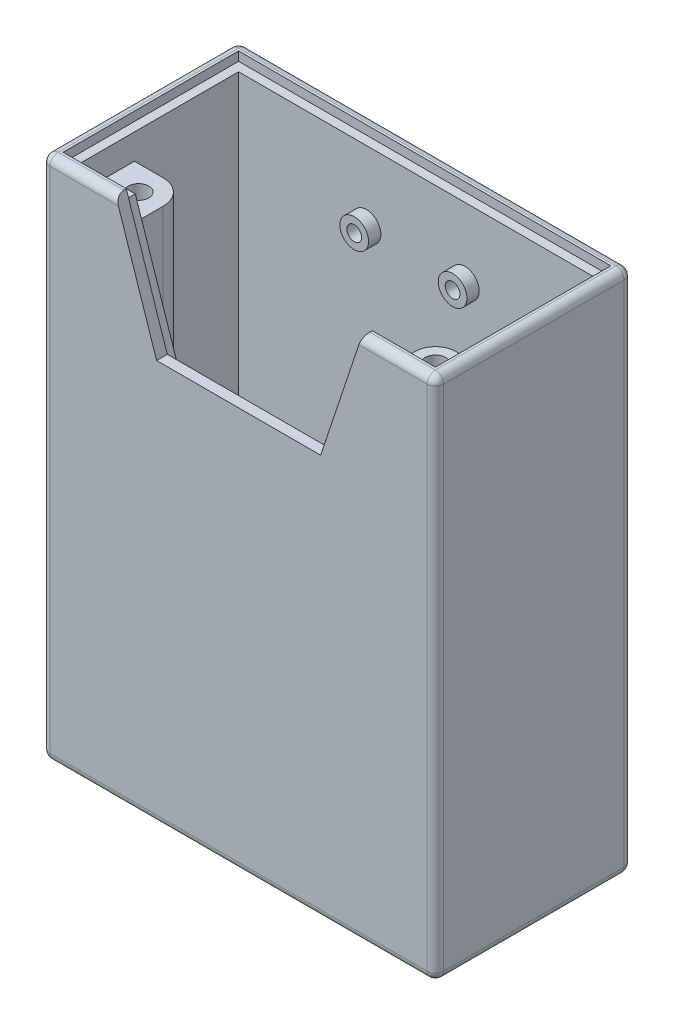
ISO-10303-21;
HEADER;
FILE_DESCRIPTION(('STEP AP214'),'2;1');
FILE_NAME('part.step','',(''),(''),'','','');
FILE_SCHEMA(('AUTOMOTIVE_DESIGN { 1 0 10303 214 1 1 1 1 }'));
ENDSEC;
DATA;
#1=APPLICATION_CONTEXT('core data for automotive mechanical design processes');
#2=APPLICATION_PROTOCOL_DEFINITION('international standard','automotive_design',2000,#1);
#3=PRODUCT_CONTEXT('',#1,'mechanical');
#4=PRODUCT('Part','Part','',(#3));
#5=PRODUCT_RELATED_PRODUCT_CATEGORY('part','',(#4));
#6=PRODUCT_DEFINITION_FORMATION('','',#4);
#7=PRODUCT_DEFINITION_CONTEXT('part definition',#1,'design');
#8=PRODUCT_DEFINITION('design','',#6,#7);
#9=PRODUCT_DEFINITION_SHAPE('','',#8);
#10=(LENGTH_UNIT() NAMED_UNIT(*) SI_UNIT(.MILLI.,.METRE.));
#11=(NAMED_UNIT(*) PLANE_ANGLE_UNIT() SI_UNIT($,.RADIAN.));
#12=(NAMED_UNIT(*) SI_UNIT($,.STERADIAN.) SOLID_ANGLE_UNIT());
#13=UNCERTAINTY_MEASURE_WITH_UNIT(LENGTH_MEASURE(1.E-05),#10,'distance_accuracy_value','');
#14=(GEOMETRIC_REPRESENTATION_CONTEXT(3) GLOBAL_UNCERTAINTY_ASSIGNED_CONTEXT((#13)) GLOBAL_UNIT_ASSIGNED_CONTEXT((#10,
#11,#12)) REPRESENTATION_CONTEXT('',''));
#15=CARTESIAN_POINT('',(0.,0.,0.));
#16=DIRECTION('',(0.,0.,1.));
#17=DIRECTION('',(1.,0.,0.));
#18=AXIS2_PLACEMENT_3D('',#15,#16,#17);
#19=CARTESIAN_POINT('',(-18.1,52.8,6.1));
#20=DIRECTION('',(0.,1.,0.));
#21=DIRECTION('',(0.,0.,1.));
#22=AXIS2_PLACEMENT_3D('',#19,#20,#21);
#23=PLANE('',#22);
#24=CARTESIAN_POINT('',(-18.1,52.8,6.1));
#25=DIRECTION('',(0.,1.,0.));
#26=DIRECTION('',(0.,0.,1.));
#27=AXIS2_PLACEMENT_3D('',#24,#25,#26);
#28=CIRCLE('',#27,1.25);
#29=CARTESIAN_POINT('',(-18.1,52.8,7.35));
#30=VERTEX_POINT('',#29);
#31=EDGE_CURVE('E555',#30,#30,#28,.T.);
#32=ORIENTED_EDGE('',*,*,#31,.T.);
#33=EDGE_LOOP('',(#32));
#34=FACE_BOUND('',#33,.T.);
#35=CARTESIAN_POINT('',(-18.1,52.8,6.1));
#36=DIRECTION('',(0.,1.,0.));
#37=DIRECTION('',(0.,0.,1.));
#38=AXIS2_PLACEMENT_3D('',#35,#36,#37);
#39=CIRCLE('',#38,1.3);
#40=CARTESIAN_POINT('',(-18.1,52.8,7.4));
#41=VERTEX_POINT('',#40);
#42=EDGE_CURVE('E599',#41,#41,#39,.F.);
#43=ORIENTED_EDGE('',*,*,#42,.T.);
#44=EDGE_LOOP('',(#43));
#45=FACE_BOUND('',#44,.T.);
#46=ADVANCED_FACE('F37',(#34,#45),#23,.F.);
#47=CARTESIAN_POINT('',(-21.6,64.,9.6));
#48=DIRECTION('',(0.,0.,-1.));
#49=DIRECTION('',(-1.,0.,0.));
#50=AXIS2_PLACEMENT_3D('',#47,#48,#49);
#51=PLANE('',#50);
#52=DIRECTION('',(0.,-1.,0.));
#53=VECTOR('',#52,1.);
#54=CARTESIAN_POINT('',(-15.1,59.8,9.6));
#55=LINE('',#54,#53);
#56=CARTESIAN_POINT('',(-15.1,59.8,9.6));
#57=VERTEX_POINT('',#56);
#58=CARTESIAN_POINT('',(-15.1,19.6,9.6));
#59=VERTEX_POINT('',#58);
#60=EDGE_CURVE('E612',#57,#59,#55,.T.);
#61=ORIENTED_EDGE('',*,*,#60,.F.);
#62=DIRECTION('',(1.,0.,0.));
#63=VECTOR('',#62,1.);
#64=CARTESIAN_POINT('',(-21.6,59.8,9.6));
#65=LINE('',#64,#63);
#66=CARTESIAN_POINT('',(-21.6,59.8,9.6));
#67=VERTEX_POINT('',#66);
#68=EDGE_CURVE('E543',#67,#57,#65,.T.);
#69=ORIENTED_EDGE('',*,*,#68,.F.);
#70=DIRECTION('',(0.,-1.,0.));
#71=VECTOR('',#70,1.);
#72=CARTESIAN_POINT('',(-21.6,64.,9.6));
#73=LINE('',#72,#71);
#74=CARTESIAN_POINT('',(-21.6,62.9,9.6));
#75=VERTEX_POINT('',#74);
#76=EDGE_CURVE('E1168',#75,#67,#73,.T.);
#77=ORIENTED_EDGE('',*,*,#76,.F.);
#78=DIRECTION('',(-1.,0.,0.));
#79=VECTOR('',#78,1.);
#80=CARTESIAN_POINT('',(-15.,62.9,9.6));
#81=LINE('',#80,#79);
#82=CARTESIAN_POINT('',(-15.,62.9,9.6));
#83=VERTEX_POINT('',#82);
#84=EDGE_CURVE('E475',#83,#75,#81,.T.);
#85=ORIENTED_EDGE('',*,*,#84,.F.);
#86=DIRECTION('',(-0.316227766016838,0.948683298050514,0.));
#87=VECTOR('',#86,1.);
#88=CARTESIAN_POINT('',(-15.,62.9,9.6));
#89=LINE('',#88,#87);
#90=CARTESIAN_POINT('',(-10.,47.9,9.6));
#91=VERTEX_POINT('',#90);
#92=EDGE_CURVE('E504',#91,#83,#89,.T.);
#93=ORIENTED_EDGE('',*,*,#92,.F.);
#94=DIRECTION('',(-1.,0.,0.));
#95=VECTOR('',#94,1.);
#96=CARTESIAN_POINT('',(-10.,47.9,9.6));
#97=LINE('',#96,#95);
#98=CARTESIAN_POINT('',(9.99999999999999,47.9,9.6));
#99=VERTEX_POINT('',#98);
#100=EDGE_CURVE('E507',#99,#91,#97,.T.);
#101=ORIENTED_EDGE('',*,*,#100,.F.);
#102=DIRECTION('',(-0.316227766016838,-0.948683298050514,0.));
#103=VECTOR('',#102,1.);
#104=CARTESIAN_POINT('',(9.99999999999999,47.9,9.6));
#105=LINE('',#104,#103);
#106=CARTESIAN_POINT('',(15.,62.9,9.6));
#107=VERTEX_POINT('',#106);
#108=EDGE_CURVE('E510',#107,#99,#105,.T.);
#109=ORIENTED_EDGE('',*,*,#108,.F.);
#110=DIRECTION('',(-1.,0.,0.));
#111=VECTOR('',#110,1.);
#112=CARTESIAN_POINT('',(21.6,62.9,9.6));
#113=LINE('',#112,#111);
#114=CARTESIAN_POINT('',(21.6,62.9,9.6));
#115=VERTEX_POINT('',#114);
#116=EDGE_CURVE('E483',#115,#107,#113,.T.);
#117=ORIENTED_EDGE('',*,*,#116,.F.);
#118=DIRECTION('',(0.,-1.,0.));
#119=VECTOR('',#118,1.);
#120=CARTESIAN_POINT('',(21.6,64.,9.6));
#121=LINE('',#120,#119);
#122=CARTESIAN_POINT('',(21.6,59.8,9.6));
#123=VERTEX_POINT('',#122);
#124=EDGE_CURVE('E1170',#115,#123,#121,.T.);
#125=ORIENTED_EDGE('',*,*,#124,.T.);
#126=DIRECTION('',(1.,0.,0.));
#127=VECTOR('',#126,1.);
#128=CARTESIAN_POINT('',(15.6,59.8,9.6));
#129=LINE('',#128,#127);
#130=CARTESIAN_POINT('',(15.6,59.8,9.6));
#131=VERTEX_POINT('',#130);
#132=EDGE_CURVE('E588',#131,#123,#129,.T.);
#133=ORIENTED_EDGE('',*,*,#132,.F.);
#134=DIRECTION('',(0.,1.,0.));
#135=VECTOR('',#134,1.);
#136=CARTESIAN_POINT('',(15.6,52.8,9.6));
#137=LINE('',#136,#135);
#138=CARTESIAN_POINT('',(15.6,52.8,9.6));
#139=VERTEX_POINT('',#138);
#140=EDGE_CURVE('E601',#139,#131,#137,.T.);
#141=ORIENTED_EDGE('',*,*,#140,.F.);
#142=DIRECTION('',(1.,0.,0.));
#143=VECTOR('',#142,1.);
#144=CARTESIAN_POINT('',(15.6,52.8,9.6));
#145=LINE('',#144,#143);
#146=CARTESIAN_POINT('',(21.6,52.8,9.6));
#147=VERTEX_POINT('',#146);
#148=EDGE_CURVE('E575',#139,#147,#145,.T.);
#149=ORIENTED_EDGE('',*,*,#148,.T.);
#150=CARTESIAN_POINT('',(21.6,19.6,9.6));
#151=VERTEX_POINT('',#150);
#152=EDGE_CURVE('E1174',#147,#151,#121,.T.);
#153=ORIENTED_EDGE('',*,*,#152,.T.);
#154=DIRECTION('',(1.,0.,0.));
#155=VECTOR('',#154,1.);
#156=CARTESIAN_POINT('',(21.6,19.6,9.6));
#157=LINE('',#156,#155);
#158=CARTESIAN_POINT('',(12.9,19.6,9.6));
#159=VERTEX_POINT('',#158);
#160=EDGE_CURVE('E426',#159,#151,#157,.T.);
#161=ORIENTED_EDGE('',*,*,#160,.F.);
#162=DIRECTION('',(0.,-1.,0.));
#163=VECTOR('',#162,1.);
#164=CARTESIAN_POINT('',(12.9,19.6,9.6));
#165=LINE('',#164,#163);
#166=CARTESIAN_POINT('',(12.9,8.,9.6));
#167=VERTEX_POINT('',#166);
#168=EDGE_CURVE('E429',#159,#167,#165,.T.);
#169=ORIENTED_EDGE('',*,*,#168,.T.);
#170=DIRECTION('',(1.,0.,0.));
#171=VECTOR('',#170,1.);
#172=CARTESIAN_POINT('',(-21.6,8.,9.6));
#173=LINE('',#172,#171);
#174=CARTESIAN_POINT('',(-1.40336756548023,8.,9.6));
#175=VERTEX_POINT('',#174);
#176=EDGE_CURVE('E365',#175,#167,#173,.T.);
#177=ORIENTED_EDGE('',*,*,#176,.F.);
#178=CARTESIAN_POINT('',(-6.59663243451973,8.,9.6));
#179=VERTEX_POINT('',#178);
#180=EDGE_CURVE('E366',#179,#175,#173,.T.);
#181=ORIENTED_EDGE('',*,*,#180,.F.);
#182=CARTESIAN_POINT('',(-10.4,8.,9.6));
#183=VERTEX_POINT('',#182);
#184=EDGE_CURVE('E368',#183,#179,#173,.T.);
#185=ORIENTED_EDGE('',*,*,#184,.F.);
#186=DIRECTION('',(0.,-1.,0.));
#187=VECTOR('',#186,1.);
#188=CARTESIAN_POINT('',(-10.4,19.6,9.6));
#189=LINE('',#188,#187);
#190=CARTESIAN_POINT('',(-10.4,19.6,9.6));
#191=VERTEX_POINT('',#190);
#192=EDGE_CURVE('E398',#191,#183,#189,.T.);
#193=ORIENTED_EDGE('',*,*,#192,.F.);
#194=DIRECTION('',(1.,0.,0.));
#195=VECTOR('',#194,1.);
#196=CARTESIAN_POINT('',(-21.6,19.6,9.6));
#197=LINE('',#196,#195);
#198=EDGE_CURVE('E415',#59,#191,#197,.T.);
#199=ORIENTED_EDGE('',*,*,#198,.F.);
#200=EDGE_LOOP('',(#61,#69,#77,#85,#93,#101,#109,#117,#125,#133,#141,#149,#153,#161,#169,#177,
#181,#185,#193,#199));
#201=FACE_BOUND('',#200,.T.);
#202=ADVANCED_FACE('F714',(#201),#51,.T.);
#203=CARTESIAN_POINT('',(21.6,64.,-9.6));
#204=DIRECTION('',(-1.,0.,0.));
#205=DIRECTION('',(0.,0.,1.));
#206=AXIS2_PLACEMENT_3D('',#203,#204,#205);
#207=PLANE('',#206);
#208=ORIENTED_EDGE('',*,*,#152,.F.);
#209=DIRECTION('',(0.,0.,-1.));
#210=VECTOR('',#209,1.);
#211=CARTESIAN_POINT('',(21.6,52.8,9.6));
#212=LINE('',#211,#210);
#213=CARTESIAN_POINT('',(21.6,52.8,3.6));
#214=VERTEX_POINT('',#213);
#215=EDGE_CURVE('E577',#147,#214,#212,.T.);
#216=ORIENTED_EDGE('',*,*,#215,.T.);
#217=DIRECTION('',(0.,1.,0.));
#218=VECTOR('',#217,1.);
#219=CARTESIAN_POINT('',(21.6,52.8,3.6));
#220=LINE('',#219,#218);
#221=CARTESIAN_POINT('',(21.6,59.8,3.6));
#222=VERTEX_POINT('',#221);
#223=EDGE_CURVE('E598',#214,#222,#220,.T.);
#224=ORIENTED_EDGE('',*,*,#223,.T.);
#225=DIRECTION('',(0.,0.,-1.));
#226=VECTOR('',#225,1.);
#227=CARTESIAN_POINT('',(21.6,59.8,9.6));
#228=LINE('',#227,#226);
#229=EDGE_CURVE('E591',#123,#222,#228,.T.);
#230=ORIENTED_EDGE('',*,*,#229,.F.);
#231=ORIENTED_EDGE('',*,*,#124,.F.);
#232=DIRECTION('',(0.,0.,1.));
#233=VECTOR('',#232,1.);
#234=CARTESIAN_POINT('',(21.6,62.9,-9.6));
#235=LINE('',#234,#233);
#236=CARTESIAN_POINT('',(21.6,62.9,-9.6));
#237=VERTEX_POINT('',#236);
#238=EDGE_CURVE('E481',#237,#115,#235,.T.);
#239=ORIENTED_EDGE('',*,*,#238,.F.);
#240=DIRECTION('',(0.,-1.,0.));
#241=VECTOR('',#240,1.);
#242=CARTESIAN_POINT('',(21.6,64.,-9.6));
#243=LINE('',#242,#241);
#244=CARTESIAN_POINT('',(21.6,19.6,-9.6));
#245=VERTEX_POINT('',#244);
#246=EDGE_CURVE('E2134',#237,#245,#243,.T.);
#247=ORIENTED_EDGE('',*,*,#246,.T.);
#248=DIRECTION('',(0.,0.,-1.));
#249=VECTOR('',#248,1.);
#250=CARTESIAN_POINT('',(21.6,19.6,-9.6));
#251=LINE('',#250,#249);
#252=EDGE_CURVE('E419',#151,#245,#251,.T.);
#253=ORIENTED_EDGE('',*,*,#252,.F.);
#254=EDGE_LOOP('',(#208,#216,#224,#230,#231,#239,#247,#253));
#255=FACE_BOUND('',#254,.T.);
#256=ADVANCED_FACE('F720',(#255),#207,.T.);
#257=CARTESIAN_POINT('',(-21.6,64.,-9.6));
#258=DIRECTION('',(1.,0.,0.));
#259=DIRECTION('',(0.,0.,-1.));
#260=AXIS2_PLACEMENT_3D('',#257,#258,#259);
#261=PLANE('',#260);
#262=DIRECTION('',(0.,0.,1.));
#263=VECTOR('',#262,1.);
#264=CARTESIAN_POINT('',(-21.6,59.8,3.6));
#265=LINE('',#264,#263);
#266=CARTESIAN_POINT('',(-21.6,59.8,3.1));
#267=VERTEX_POINT('',#266);
#268=EDGE_CURVE('E552',#267,#67,#265,.T.);
#269=ORIENTED_EDGE('',*,*,#268,.F.);
#270=DIRECTION('',(0.,-1.,0.));
#271=VECTOR('',#270,1.);
#272=CARTESIAN_POINT('',(-21.6,59.8,3.1));
#273=LINE('',#272,#271);
#274=CARTESIAN_POINT('',(-21.6,19.6,3.1));
#275=VERTEX_POINT('',#274);
#276=EDGE_CURVE('E609',#267,#275,#273,.T.);
#277=ORIENTED_EDGE('',*,*,#276,.T.);
#278=DIRECTION('',(0.,0.,1.));
#279=VECTOR('',#278,1.);
#280=CARTESIAN_POINT('',(-21.6,19.6,-9.6));
#281=LINE('',#280,#279);
#282=CARTESIAN_POINT('',(-21.6,19.6,-9.6));
#283=VERTEX_POINT('',#282);
#284=EDGE_CURVE('E407',#283,#275,#281,.T.);
#285=ORIENTED_EDGE('',*,*,#284,.F.);
#286=DIRECTION('',(0.,-1.,0.));
#287=VECTOR('',#286,1.);
#288=CARTESIAN_POINT('',(-21.6,64.,-9.6));
#289=LINE('',#288,#287);
#290=CARTESIAN_POINT('',(-21.6,62.9,-9.6));
#291=VERTEX_POINT('',#290);
#292=EDGE_CURVE('E1169',#291,#283,#289,.T.);
#293=ORIENTED_EDGE('',*,*,#292,.F.);
#294=DIRECTION('',(0.,0.,-1.));
#295=VECTOR('',#294,1.);
#296=CARTESIAN_POINT('',(-21.6,62.9,9.6));
#297=LINE('',#296,#295);
#298=EDGE_CURVE('E477',#75,#291,#297,.T.);
#299=ORIENTED_EDGE('',*,*,#298,.F.);
#300=ORIENTED_EDGE('',*,*,#76,.T.);
#301=EDGE_LOOP('',(#269,#277,#285,#293,#299,#300));
#302=FACE_BOUND('',#301,.T.);
#303=ADVANCED_FACE('F847',(#302),#261,.T.);
#304=CARTESIAN_POINT('',(0.,64.,0.));
#305=DIRECTION('',(0.,1.,0.));
#306=DIRECTION('',(0.,0.,1.));
#307=AXIS2_PLACEMENT_3D('',#304,#305,#306);
#308=PLANE('',#307);
#309=DIRECTION('',(0.,0.,1.));
#310=VECTOR('',#309,1.);
#311=CARTESIAN_POINT('',(15.,64.,-23.9410196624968));
#312=LINE('',#311,#310);
#313=CARTESIAN_POINT('',(15.,64.,10.7));
#314=VERTEX_POINT('',#313);
#315=CARTESIAN_POINT('',(15.,64.,11.));
#316=VERTEX_POINT('',#315);
#317=EDGE_CURVE('E370',#314,#316,#312,.T.);
#318=ORIENTED_EDGE('',*,*,#317,.T.);
#319=DIRECTION('',(1.,0.,0.));
#320=VECTOR('',#319,1.);
#321=CARTESIAN_POINT('',(24.,64.,11.));
#322=LINE('',#321,#320);
#323=CARTESIAN_POINT('',(23.,64.,11.));
#324=VERTEX_POINT('',#323);
#325=EDGE_CURVE('E54',#316,#324,#322,.T.);
#326=ORIENTED_EDGE('',*,*,#325,.T.);
#327=DIRECTION('',(0.,0.,-1.));
#328=VECTOR('',#327,1.);
#329=CARTESIAN_POINT('',(23.,64.,-12.));
#330=LINE('',#329,#328);
#331=CARTESIAN_POINT('',(23.,64.,-11.));
#332=VERTEX_POINT('',#331);
#333=EDGE_CURVE('E59',#324,#332,#330,.T.);
#334=ORIENTED_EDGE('',*,*,#333,.T.);
#335=DIRECTION('',(-1.,0.,0.));
#336=VECTOR('',#335,1.);
#337=CARTESIAN_POINT('',(-24.,64.,-11.));
#338=LINE('',#337,#336);
#339=CARTESIAN_POINT('',(-23.,64.,-11.));
#340=VERTEX_POINT('',#339);
#341=EDGE_CURVE('E1032',#332,#340,#338,.T.);
#342=ORIENTED_EDGE('',*,*,#341,.T.);
#343=DIRECTION('',(0.,0.,1.));
#344=VECTOR('',#343,1.);
#345=CARTESIAN_POINT('',(-23.,64.,12.));
#346=LINE('',#345,#344);
#347=CARTESIAN_POINT('',(-23.,64.,11.));
#348=VERTEX_POINT('',#347);
#349=EDGE_CURVE('E1029',#340,#348,#346,.T.);
#350=ORIENTED_EDGE('',*,*,#349,.T.);
#351=DIRECTION('',(1.,0.,0.));
#352=VECTOR('',#351,1.);
#353=CARTESIAN_POINT('',(-15.,64.,11.));
#354=LINE('',#353,#352);
#355=CARTESIAN_POINT('',(-15.,64.,11.));
#356=VERTEX_POINT('',#355);
#357=EDGE_CURVE('E1015',#348,#356,#354,.T.);
#358=ORIENTED_EDGE('',*,*,#357,.T.);
#359=DIRECTION('',(0.,0.,1.));
#360=VECTOR('',#359,1.);
#361=CARTESIAN_POINT('',(-15.,64.,-23.9410196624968));
#362=LINE('',#361,#360);
#363=CARTESIAN_POINT('',(-15.,64.,10.7));
#364=VERTEX_POINT('',#363);
#365=EDGE_CURVE('E379',#364,#356,#362,.T.);
#366=ORIENTED_EDGE('',*,*,#365,.F.);
#367=DIRECTION('',(-1.,0.,0.));
#368=VECTOR('',#367,1.);
#369=CARTESIAN_POINT('',(-15.,64.,10.7));
#370=LINE('',#369,#368);
#371=CARTESIAN_POINT('',(-22.7,64.,10.7));
#372=VERTEX_POINT('',#371);
#373=EDGE_CURVE('E469',#364,#372,#370,.T.);
#374=ORIENTED_EDGE('',*,*,#373,.T.);
#375=DIRECTION('',(0.,0.,-1.));
#376=VECTOR('',#375,1.);
#377=CARTESIAN_POINT('',(-22.7,64.,10.7));
#378=LINE('',#377,#376);
#379=CARTESIAN_POINT('',(-22.7,64.,-10.7));
#380=VERTEX_POINT('',#379);
#381=EDGE_CURVE('E466',#372,#380,#378,.T.);
#382=ORIENTED_EDGE('',*,*,#381,.T.);
#383=DIRECTION('',(1.,0.,0.));
#384=VECTOR('',#383,1.);
#385=CARTESIAN_POINT('',(-22.7,64.,-10.7));
#386=LINE('',#385,#384);
#387=CARTESIAN_POINT('',(22.7,64.,-10.7));
#388=VERTEX_POINT('',#387);
#389=EDGE_CURVE('E463',#380,#388,#386,.T.);
#390=ORIENTED_EDGE('',*,*,#389,.T.);
#391=DIRECTION('',(0.,0.,1.));
#392=VECTOR('',#391,1.);
#393=CARTESIAN_POINT('',(22.7,64.,-10.7));
#394=LINE('',#393,#392);
#395=CARTESIAN_POINT('',(22.7,64.,10.7));
#396=VERTEX_POINT('',#395);
#397=EDGE_CURVE('E460',#388,#396,#394,.T.);
#398=ORIENTED_EDGE('',*,*,#397,.T.);
#399=DIRECTION('',(-1.,0.,0.));
#400=VECTOR('',#399,1.);
#401=CARTESIAN_POINT('',(22.7,64.,10.7));
#402=LINE('',#401,#400);
#403=EDGE_CURVE('E457',#396,#314,#402,.T.);
#404=ORIENTED_EDGE('',*,*,#403,.T.);
#405=EDGE_LOOP('',(#318,#326,#334,#342,#350,#358,#366,#374,#382,#390,#398,#404));
#406=FACE_BOUND('',#405,.T.);
#407=ADVANCED_FACE('F852',(#406),#308,.T.);
#408=CARTESIAN_POINT('',(-21.6,64.,-9.6));
#409=DIRECTION('',(0.,0.,1.));
#410=DIRECTION('',(1.,0.,0.));
#411=AXIS2_PLACEMENT_3D('',#408,#409,#410);
#412=PLANE('',#411);
#413=CARTESIAN_POINT('',(6.,54.4,-9.6));
#414=DIRECTION('',(0.,0.,1.));
#415=DIRECTION('',(-1.,0.,0.));
#416=AXIS2_PLACEMENT_3D('',#413,#414,#415);
#417=CIRCLE('',#416,1.75);
#418=CARTESIAN_POINT('',(4.25,54.4,-9.6));
#419=VERTEX_POINT('',#418);
#420=EDGE_CURVE('E530',#419,#419,#417,.T.);
#421=ORIENTED_EDGE('',*,*,#420,.F.);
#422=EDGE_LOOP('',(#421));
#423=FACE_BOUND('',#422,.T.);
#424=CARTESIAN_POINT('',(-6.,54.4,-9.6));
#425=DIRECTION('',(0.,0.,1.));
#426=DIRECTION('',(1.,0.,0.));
#427=AXIS2_PLACEMENT_3D('',#424,#425,#426);
#428=CIRCLE('',#427,1.75);
#429=CARTESIAN_POINT('',(-4.25,54.4,-9.6));
#430=VERTEX_POINT('',#429);
#431=EDGE_CURVE('E527',#430,#430,#428,.T.);
#432=ORIENTED_EDGE('',*,*,#431,.F.);
#433=EDGE_LOOP('',(#432));
#434=FACE_BOUND('',#433,.T.);
#435=DIRECTION('',(1.,0.,0.));
#436=VECTOR('',#435,1.);
#437=CARTESIAN_POINT('',(-21.6,62.9,-9.6));
#438=LINE('',#437,#436);
#439=EDGE_CURVE('E479',#291,#237,#438,.T.);
#440=ORIENTED_EDGE('',*,*,#439,.F.);
#441=ORIENTED_EDGE('',*,*,#292,.T.);
#442=DIRECTION('',(-1.,0.,0.));
#443=VECTOR('',#442,1.);
#444=CARTESIAN_POINT('',(-21.6,19.6,-9.6));
#445=LINE('',#444,#443);
#446=CARTESIAN_POINT('',(-10.4,19.6,-9.6));
#447=VERTEX_POINT('',#446);
#448=EDGE_CURVE('E403',#447,#283,#445,.T.);
#449=ORIENTED_EDGE('',*,*,#448,.F.);
#450=DIRECTION('',(0.,-1.,0.));
#451=VECTOR('',#450,1.);
#452=CARTESIAN_POINT('',(-10.4,19.6,-9.6));
#453=LINE('',#452,#451);
#454=CARTESIAN_POINT('',(-10.4,8.,-9.6));
#455=VERTEX_POINT('',#454);
#456=EDGE_CURVE('E401',#447,#455,#453,.T.);
#457=ORIENTED_EDGE('',*,*,#456,.T.);
#458=DIRECTION('',(-1.,0.,0.));
#459=VECTOR('',#458,1.);
#460=CARTESIAN_POINT('',(-21.6,8.,-9.6));
#461=LINE('',#460,#459);
#462=CARTESIAN_POINT('',(-6.59663243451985,8.,-9.6));
#463=VERTEX_POINT('',#462);
#464=EDGE_CURVE('E358',#463,#455,#461,.T.);
#465=ORIENTED_EDGE('',*,*,#464,.F.);
#466=CARTESIAN_POINT('',(-1.40336756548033,8.,-9.6));
#467=VERTEX_POINT('',#466);
#468=EDGE_CURVE('E340',#467,#463,#461,.T.);
#469=ORIENTED_EDGE('',*,*,#468,.F.);
#470=CARTESIAN_POINT('',(12.9,8.,-9.59999999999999));
#471=VERTEX_POINT('',#470);
#472=EDGE_CURVE('E356',#471,#467,#461,.T.);
#473=ORIENTED_EDGE('',*,*,#472,.F.);
#474=DIRECTION('',(0.,-1.,0.));
#475=VECTOR('',#474,1.);
#476=CARTESIAN_POINT('',(12.9,19.6,-9.59999999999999));
#477=LINE('',#476,#475);
#478=CARTESIAN_POINT('',(12.9,19.6,-9.59999999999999));
#479=VERTEX_POINT('',#478);
#480=EDGE_CURVE('E433',#479,#471,#477,.T.);
#481=ORIENTED_EDGE('',*,*,#480,.F.);
#482=DIRECTION('',(-1.,0.,0.));
#483=VECTOR('',#482,1.);
#484=CARTESIAN_POINT('',(21.6,19.6,-9.6));
#485=LINE('',#484,#483);
#486=EDGE_CURVE('E422',#245,#479,#485,.T.);
#487=ORIENTED_EDGE('',*,*,#486,.F.);
#488=ORIENTED_EDGE('',*,*,#246,.F.);
#489=EDGE_LOOP('',(#440,#441,#449,#457,#465,#469,#473,#481,#487,#488));
#490=FACE_BOUND('',#489,.T.);
#491=ADVANCED_FACE('F354',(#423,#434,#490),#412,.T.);
#492=CARTESIAN_POINT('',(0.,8.,0.));
#493=DIRECTION('',(0.,-1.,0.));
#494=DIRECTION('',(0.,0.,-1.));
#495=AXIS2_PLACEMENT_3D('',#492,#493,#494);
#496=PLANE('',#495);
#497=CARTESIAN_POINT('',(-4.00000000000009,8.,-8.));
#498=DIRECTION('',(0.,1.,0.));
#499=DIRECTION('',(0.,0.,-1.));
#500=AXIS2_PLACEMENT_3D('',#497,#498,#499);
#501=CIRCLE('',#500,3.05);
#502=EDGE_CURVE('E343',#463,#467,#501,.T.);
#503=ORIENTED_EDGE('',*,*,#502,.F.);
#504=ORIENTED_EDGE('',*,*,#464,.T.);
#505=DIRECTION('',(0.,0.,-1.));
#506=VECTOR('',#505,1.);
#507=CARTESIAN_POINT('',(-10.4,8.,-9.6));
#508=LINE('',#507,#506);
#509=CARTESIAN_POINT('',(-10.4,8.,-2.59663243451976));
#510=VERTEX_POINT('',#509);
#511=EDGE_CURVE('E409',#510,#455,#508,.T.);
#512=ORIENTED_EDGE('',*,*,#511,.F.);
#513=CARTESIAN_POINT('',(-12.,8.,0.));
#514=DIRECTION('',(0.,1.,0.));
#515=DIRECTION('',(-1.,0.,0.));
#516=AXIS2_PLACEMENT_3D('',#513,#514,#515);
#517=CIRCLE('',#516,3.05);
#518=CARTESIAN_POINT('',(-10.4,8.,2.59663243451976));
#519=VERTEX_POINT('',#518);
#520=EDGE_CURVE('E647',#519,#510,#517,.T.);
#521=ORIENTED_EDGE('',*,*,#520,.F.);
#522=EDGE_CURVE('E404',#183,#519,#508,.T.);
#523=ORIENTED_EDGE('',*,*,#522,.F.);
#524=ORIENTED_EDGE('',*,*,#184,.T.);
#525=CARTESIAN_POINT('',(-3.99999999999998,8.,8.));
#526=DIRECTION('',(0.,1.,0.));
#527=DIRECTION('',(0.,0.,1.));
#528=AXIS2_PLACEMENT_3D('',#525,#526,#527);
#529=CIRCLE('',#528,3.05);
#530=EDGE_CURVE('E665',#175,#179,#529,.T.);
#531=ORIENTED_EDGE('',*,*,#530,.F.);
#532=ORIENTED_EDGE('',*,*,#176,.T.);
#533=DIRECTION('',(0.,0.,1.));
#534=VECTOR('',#533,1.);
#535=CARTESIAN_POINT('',(12.9,8.,-9.59999999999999));
#536=LINE('',#535,#534);
#537=EDGE_CURVE('E364',#471,#167,#536,.T.);
#538=ORIENTED_EDGE('',*,*,#537,.F.);
#539=ORIENTED_EDGE('',*,*,#472,.T.);
#540=EDGE_LOOP('',(#503,#504,#512,#521,#523,#524,#531,#532,#538,#539));
#541=FACE_BOUND('',#540,.T.);
#542=CARTESIAN_POINT('',(3.99999999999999,8.,0.));
#543=DIRECTION('',(0.,1.,0.));
#544=DIRECTION('',(1.,0.,0.));
#545=AXIS2_PLACEMENT_3D('',#542,#543,#544);
#546=CIRCLE('',#545,3.05);
#547=CARTESIAN_POINT('',(7.04999999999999,8.,0.));
#548=VERTEX_POINT('',#547);
#549=EDGE_CURVE('E684',#548,#548,#546,.T.);
#550=ORIENTED_EDGE('',*,*,#549,.F.);
#551=EDGE_LOOP('',(#550));
#552=FACE_BOUND('',#551,.T.);
#553=CARTESIAN_POINT('',(-4.00000000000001,8.,0.));
#554=DIRECTION('',(0.,-1.,0.));
#555=DIRECTION('',(0.,0.,-1.));
#556=AXIS2_PLACEMENT_3D('',#553,#554,#555);
#557=CIRCLE('',#556,4.);
#558=CARTESIAN_POINT('',(-4.00000000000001,8.,-4.));
#559=VERTEX_POINT('',#558);
#560=EDGE_CURVE('E389',#559,#559,#557,.F.);
#561=ORIENTED_EDGE('',*,*,#560,.F.);
#562=EDGE_LOOP('',(#561));
#563=FACE_BOUND('',#562,.T.);
#564=ADVANCED_FACE('F361',(#541,#552,#563),#496,.F.);
#565=CARTESIAN_POINT('',(-24.,8.,-12.));
#566=DIRECTION('',(1.,0.,0.));
#567=DIRECTION('',(0.,0.,-1.));
#568=AXIS2_PLACEMENT_3D('',#565,#566,#567);
#569=PLANE('',#568);
#570=DIRECTION('',(0.,0.,1.));
#571=VECTOR('',#570,1.);
#572=CARTESIAN_POINT('',(-24.,63.,-12.));
#573=LINE('',#572,#571);
#574=CARTESIAN_POINT('',(-24.,63.,11.));
#575=VERTEX_POINT('',#574);
#576=CARTESIAN_POINT('',(-24.,63.,-11.));
#577=VERTEX_POINT('',#576);
#578=EDGE_CURVE('E896',#575,#577,#573,.F.);
#579=ORIENTED_EDGE('',*,*,#578,.T.);
#580=DIRECTION('',(0.,-1.,0.));
#581=VECTOR('',#580,1.);
#582=CARTESIAN_POINT('',(-24.,8.,-11.));
#583=LINE('',#582,#581);
#584=CARTESIAN_POINT('',(-24.,1.,-11.));
#585=VERTEX_POINT('',#584);
#586=EDGE_CURVE('E1140',#577,#585,#583,.T.);
#587=ORIENTED_EDGE('',*,*,#586,.T.);
#588=DIRECTION('',(0.,0.,1.));
#589=VECTOR('',#588,1.);
#590=CARTESIAN_POINT('',(-24.,1.,12.));
#591=LINE('',#590,#589);
#592=CARTESIAN_POINT('',(-24.,1.,11.));
#593=VERTEX_POINT('',#592);
#594=EDGE_CURVE('E1253',#585,#593,#591,.T.);
#595=ORIENTED_EDGE('',*,*,#594,.T.);
#596=DIRECTION('',(0.,-1.,0.));
#597=VECTOR('',#596,1.);
#598=CARTESIAN_POINT('',(-24.,8.,11.));
#599=LINE('',#598,#597);
#600=EDGE_CURVE('E1255',#593,#575,#599,.F.);
#601=ORIENTED_EDGE('',*,*,#600,.T.);
#602=EDGE_LOOP('',(#579,#587,#595,#601));
#603=FACE_BOUND('',#602,.T.);
#604=ADVANCED_FACE('F861',(#603),#569,.F.);
#605=CARTESIAN_POINT('',(24.,8.,12.));
#606=DIRECTION('',(0.,0.,-1.));
#607=DIRECTION('',(-1.,0.,0.));
#608=AXIS2_PLACEMENT_3D('',#605,#606,#607);
#609=PLANE('',#608);
#610=DIRECTION('',(0.,-1.,0.));
#611=VECTOR('',#610,1.);
#612=CARTESIAN_POINT('',(23.,8.,12.));
#613=LINE('',#612,#611);
#614=CARTESIAN_POINT('',(23.,1.,12.));
#615=VERTEX_POINT('',#614);
#616=CARTESIAN_POINT('',(23.,63.,12.));
#617=VERTEX_POINT('',#616);
#618=EDGE_CURVE('E1114',#615,#617,#613,.F.);
#619=ORIENTED_EDGE('',*,*,#618,.T.);
#620=DIRECTION('',(1.,0.,0.));
#621=VECTOR('',#620,1.);
#622=CARTESIAN_POINT('',(15.,63.,12.));
#623=LINE('',#622,#621);
#624=CARTESIAN_POINT('',(14.6666666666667,63.,12.));
#625=VERTEX_POINT('',#624);
#626=EDGE_CURVE('E966',#617,#625,#623,.F.);
#627=ORIENTED_EDGE('',*,*,#626,.T.);
#628=DIRECTION('',(0.316227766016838,0.948683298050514,0.));
#629=VECTOR('',#628,1.);
#630=CARTESIAN_POINT('',(15.,64.,12.));
#631=LINE('',#630,#629);
#632=CARTESIAN_POINT('',(10.,49.,12.));
#633=VERTEX_POINT('',#632);
#634=EDGE_CURVE('E385',#633,#625,#631,.T.);
#635=ORIENTED_EDGE('',*,*,#634,.F.);
#636=DIRECTION('',(1.,0.,0.));
#637=VECTOR('',#636,1.);
#638=CARTESIAN_POINT('',(-10.,49.,12.));
#639=LINE('',#638,#637);
#640=CARTESIAN_POINT('',(-10.,49.,12.));
#641=VERTEX_POINT('',#640);
#642=EDGE_CURVE('E382',#641,#633,#639,.T.);
#643=ORIENTED_EDGE('',*,*,#642,.F.);
#644=DIRECTION('',(0.316227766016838,-0.948683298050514,0.));
#645=VECTOR('',#644,1.);
#646=CARTESIAN_POINT('',(-15.,64.,12.));
#647=LINE('',#646,#645);
#648=CARTESIAN_POINT('',(-14.6666666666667,63.,12.));
#649=VERTEX_POINT('',#648);
#650=EDGE_CURVE('E388',#649,#641,#647,.T.);
#651=ORIENTED_EDGE('',*,*,#650,.F.);
#652=DIRECTION('',(1.,0.,0.));
#653=VECTOR('',#652,1.);
#654=CARTESIAN_POINT('',(-24.,63.,12.));
#655=LINE('',#654,#653);
#656=CARTESIAN_POINT('',(-23.,63.,12.));
#657=VERTEX_POINT('',#656);
#658=EDGE_CURVE('E1017',#649,#657,#655,.F.);
#659=ORIENTED_EDGE('',*,*,#658,.T.);
#660=DIRECTION('',(0.,-1.,0.));
#661=VECTOR('',#660,1.);
#662=CARTESIAN_POINT('',(-23.,8.,12.));
#663=LINE('',#662,#661);
#664=CARTESIAN_POINT('',(-23.,1.,12.));
#665=VERTEX_POINT('',#664);
#666=EDGE_CURVE('E1135',#657,#665,#663,.T.);
#667=ORIENTED_EDGE('',*,*,#666,.T.);
#668=DIRECTION('',(1.,0.,0.));
#669=VECTOR('',#668,1.);
#670=CARTESIAN_POINT('',(24.,1.,12.));
#671=LINE('',#670,#669);
#672=EDGE_CURVE('E1137',#665,#615,#671,.T.);
#673=ORIENTED_EDGE('',*,*,#672,.T.);
#674=EDGE_LOOP('',(#619,#627,#635,#643,#651,#659,#667,#673));
#675=FACE_BOUND('',#674,.T.);
#676=ADVANCED_FACE('F872',(#675),#609,.F.);
#677=CARTESIAN_POINT('',(24.,8.,-12.));
#678=DIRECTION('',(-1.,0.,0.));
#679=DIRECTION('',(0.,0.,1.));
#680=AXIS2_PLACEMENT_3D('',#677,#678,#679);
#681=PLANE('',#680);
#682=DIRECTION('',(0.,-1.,0.));
#683=VECTOR('',#682,1.);
#684=CARTESIAN_POINT('',(24.,8.,11.));
#685=LINE('',#684,#683);
#686=CARTESIAN_POINT('',(24.,63.,11.));
#687=VERTEX_POINT('',#686);
#688=CARTESIAN_POINT('',(24.,1.,11.));
#689=VERTEX_POINT('',#688);
#690=EDGE_CURVE('E1116',#687,#689,#685,.T.);
#691=ORIENTED_EDGE('',*,*,#690,.T.);
#692=DIRECTION('',(0.,0.,-1.));
#693=VECTOR('',#692,1.);
#694=CARTESIAN_POINT('',(24.,1.,-12.));
#695=LINE('',#694,#693);
#696=CARTESIAN_POINT('',(24.,1.,-11.));
#697=VERTEX_POINT('',#696);
#698=EDGE_CURVE('E1030',#689,#697,#695,.T.);
#699=ORIENTED_EDGE('',*,*,#698,.T.);
#700=DIRECTION('',(0.,-1.,0.));
#701=VECTOR('',#700,1.);
#702=CARTESIAN_POINT('',(24.,8.,-11.));
#703=LINE('',#702,#701);
#704=CARTESIAN_POINT('',(24.,63.,-11.));
#705=VERTEX_POINT('',#704);
#706=EDGE_CURVE('E1035',#697,#705,#703,.F.);
#707=ORIENTED_EDGE('',*,*,#706,.T.);
#708=DIRECTION('',(0.,0.,-1.));
#709=VECTOR('',#708,1.);
#710=CARTESIAN_POINT('',(24.,63.,12.));
#711=LINE('',#710,#709);
#712=EDGE_CURVE('E965',#705,#687,#711,.F.);
#713=ORIENTED_EDGE('',*,*,#712,.T.);
#714=EDGE_LOOP('',(#691,#699,#707,#713));
#715=FACE_BOUND('',#714,.T.);
#716=ADVANCED_FACE('F868',(#715),#681,.F.);
#717=CARTESIAN_POINT('',(24.,8.,-12.));
#718=DIRECTION('',(0.,0.,1.));
#719=DIRECTION('',(1.,0.,0.));
#720=AXIS2_PLACEMENT_3D('',#717,#718,#719);
#721=PLANE('',#720);
#722=DIRECTION('',(0.,-1.,0.));
#723=VECTOR('',#722,1.);
#724=CARTESIAN_POINT('',(23.,8.,-12.));
#725=LINE('',#724,#723);
#726=CARTESIAN_POINT('',(23.,63.,-12.));
#727=VERTEX_POINT('',#726);
#728=CARTESIAN_POINT('',(23.,1.,-12.));
#729=VERTEX_POINT('',#728);
#730=EDGE_CURVE('E1181',#727,#729,#725,.T.);
#731=ORIENTED_EDGE('',*,*,#730,.T.);
#732=DIRECTION('',(-1.,0.,0.));
#733=VECTOR('',#732,1.);
#734=CARTESIAN_POINT('',(-24.,1.,-12.));
#735=LINE('',#734,#733);
#736=CARTESIAN_POINT('',(-23.,1.,-12.));
#737=VERTEX_POINT('',#736);
#738=EDGE_CURVE('E1185',#729,#737,#735,.T.);
#739=ORIENTED_EDGE('',*,*,#738,.T.);
#740=DIRECTION('',(0.,-1.,0.));
#741=VECTOR('',#740,1.);
#742=CARTESIAN_POINT('',(-23.,8.,-12.));
#743=LINE('',#742,#741);
#744=CARTESIAN_POINT('',(-23.,63.,-12.));
#745=VERTEX_POINT('',#744);
#746=EDGE_CURVE('E1183',#737,#745,#743,.F.);
#747=ORIENTED_EDGE('',*,*,#746,.T.);
#748=DIRECTION('',(-1.,0.,0.));
#749=VECTOR('',#748,1.);
#750=CARTESIAN_POINT('',(24.,63.,-12.));
#751=LINE('',#750,#749);
#752=EDGE_CURVE('E1128',#745,#727,#751,.F.);
#753=ORIENTED_EDGE('',*,*,#752,.T.);
#754=EDGE_LOOP('',(#731,#739,#747,#753));
#755=FACE_BOUND('',#754,.T.);
#756=ADVANCED_FACE('F864',(#755),#721,.F.);
#757=CARTESIAN_POINT('',(0.,0.,0.));
#758=DIRECTION('',(0.,-1.,0.));
#759=DIRECTION('',(0.,0.,-1.));
#760=AXIS2_PLACEMENT_3D('',#757,#758,#759);
#761=PLANE('',#760);
#762=DIRECTION('',(0.,0.,1.));
#763=VECTOR('',#762,1.);
#764=CARTESIAN_POINT('',(-23.,0.,-12.));
#765=LINE('',#764,#763);
#766=CARTESIAN_POINT('',(-23.,0.,11.));
#767=VERTEX_POINT('',#766);
#768=CARTESIAN_POINT('',(-23.,0.,-11.));
#769=VERTEX_POINT('',#768);
#770=EDGE_CURVE('E1195',#767,#769,#765,.F.);
#771=ORIENTED_EDGE('',*,*,#770,.T.);
#772=DIRECTION('',(-1.,0.,0.));
#773=VECTOR('',#772,1.);
#774=CARTESIAN_POINT('',(24.,0.,-11.));
#775=LINE('',#774,#773);
#776=CARTESIAN_POINT('',(-4.5500000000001,0.,-11.));
#777=VERTEX_POINT('',#776);
#778=EDGE_CURVE('E897',#769,#777,#775,.F.);
#779=ORIENTED_EDGE('',*,*,#778,.T.);
#780=CARTESIAN_POINT('',(-4.00000000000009,0.,-8.));
#781=DIRECTION('',(0.,1.,0.));
#782=DIRECTION('',(0.,0.,-1.));
#783=AXIS2_PLACEMENT_3D('',#780,#781,#782);
#784=CIRCLE('',#783,3.05);
#785=CARTESIAN_POINT('',(-3.45000000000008,0.,-11.));
#786=VERTEX_POINT('',#785);
#787=EDGE_CURVE('E687',#777,#786,#784,.T.);
#788=ORIENTED_EDGE('',*,*,#787,.T.);
#789=DIRECTION('',(-1.,0.,0.));
#790=VECTOR('',#789,1.);
#791=CARTESIAN_POINT('',(24.,0.,-11.));
#792=LINE('',#791,#790);
#793=CARTESIAN_POINT('',(23.,0.,-11.));
#794=VERTEX_POINT('',#793);
#795=EDGE_CURVE('E1192',#786,#794,#792,.F.);
#796=ORIENTED_EDGE('',*,*,#795,.T.);
#797=DIRECTION('',(0.,0.,-1.));
#798=VECTOR('',#797,1.);
#799=CARTESIAN_POINT('',(23.,0.,12.));
#800=LINE('',#799,#798);
#801=CARTESIAN_POINT('',(23.,0.,11.));
#802=VERTEX_POINT('',#801);
#803=EDGE_CURVE('E1188',#794,#802,#800,.F.);
#804=ORIENTED_EDGE('',*,*,#803,.T.);
#805=DIRECTION('',(1.,0.,0.));
#806=VECTOR('',#805,1.);
#807=CARTESIAN_POINT('',(-24.,0.,11.));
#808=LINE('',#807,#806);
#809=CARTESIAN_POINT('',(-3.44999999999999,0.,11.));
#810=VERTEX_POINT('',#809);
#811=EDGE_CURVE('E1190',#802,#810,#808,.F.);
#812=ORIENTED_EDGE('',*,*,#811,.T.);
#813=CARTESIAN_POINT('',(-3.99999999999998,0.,8.));
#814=DIRECTION('',(0.,1.,0.));
#815=DIRECTION('',(0.,0.,1.));
#816=AXIS2_PLACEMENT_3D('',#813,#814,#815);
#817=CIRCLE('',#816,3.05);
#818=CARTESIAN_POINT('',(-4.54999999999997,0.,11.));
#819=VERTEX_POINT('',#818);
#820=EDGE_CURVE('E650',#810,#819,#817,.T.);
#821=ORIENTED_EDGE('',*,*,#820,.T.);
#822=DIRECTION('',(1.,0.,0.));
#823=VECTOR('',#822,1.);
#824=CARTESIAN_POINT('',(-24.,0.,11.));
#825=LINE('',#824,#823);
#826=EDGE_CURVE('E1194',#819,#767,#825,.F.);
#827=ORIENTED_EDGE('',*,*,#826,.T.);
#828=EDGE_LOOP('',(#771,#779,#788,#796,#804,#812,#821,#827));
#829=FACE_BOUND('',#828,.T.);
#830=CARTESIAN_POINT('',(3.99999999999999,0.,0.));
#831=DIRECTION('',(0.,1.,0.));
#832=DIRECTION('',(1.,0.,0.));
#833=AXIS2_PLACEMENT_3D('',#830,#831,#832);
#834=CIRCLE('',#833,3.05);
#835=CARTESIAN_POINT('',(7.04999999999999,0.,0.));
#836=VERTEX_POINT('',#835);
#837=EDGE_CURVE('E669',#836,#836,#834,.T.);
#838=ORIENTED_EDGE('',*,*,#837,.T.);
#839=EDGE_LOOP('',(#838));
#840=FACE_BOUND('',#839,.T.);
#841=CARTESIAN_POINT('',(-12.,0.,0.));
#842=DIRECTION('',(0.,1.,0.));
#843=DIRECTION('',(-1.,0.,0.));
#844=AXIS2_PLACEMENT_3D('',#841,#842,#843);
#845=CIRCLE('',#844,3.05);
#846=CARTESIAN_POINT('',(-15.05,0.,0.));
#847=VERTEX_POINT('',#846);
#848=EDGE_CURVE('E626',#847,#847,#845,.T.);
#849=ORIENTED_EDGE('',*,*,#848,.T.);
#850=EDGE_LOOP('',(#849));
#851=FACE_BOUND('',#850,.T.);
#852=CARTESIAN_POINT('',(-4.00000000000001,0.,0.));
#853=DIRECTION('',(0.,-1.,0.));
#854=DIRECTION('',(0.,0.,-1.));
#855=AXIS2_PLACEMENT_3D('',#852,#853,#854);
#856=CIRCLE('',#855,4.);
#857=CARTESIAN_POINT('',(-4.00000000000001,0.,-4.));
#858=VERTEX_POINT('',#857);
#859=EDGE_CURVE('E395',#858,#858,#856,.T.);
#860=ORIENTED_EDGE('',*,*,#859,.F.);
#861=EDGE_LOOP('',(#860));
#862=FACE_BOUND('',#861,.T.);
#863=ADVANCED_FACE('F844',(#829,#840,#851,#862),#761,.T.);
#864=CARTESIAN_POINT('',(-15.,64.,-23.9410196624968));
#865=DIRECTION('',(-0.948683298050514,-0.316227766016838,0.));
#866=DIRECTION('',(0.316227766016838,-0.948683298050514,0.));
#867=AXIS2_PLACEMENT_3D('',#864,#865,#866);
#868=PLANE('',#867);
#869=ORIENTED_EDGE('',*,*,#365,.T.);
#870=CARTESIAN_POINT('',(-14.6666666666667,63.,11.));
#871=DIRECTION('',(-0.948683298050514,-0.316227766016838,0.));
#872=DIRECTION('',(-0.316227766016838,0.948683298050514,0.));
#873=AXIS2_PLACEMENT_3D('',#870,#871,#872);
#874=ELLIPSE('',#873,1.05409255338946,1.);
#875=EDGE_CURVE('E11',#356,#649,#874,.F.);
#876=ORIENTED_EDGE('',*,*,#875,.T.);
#877=ORIENTED_EDGE('',*,*,#650,.T.);
#878=DIRECTION('',(0.,0.,1.));
#879=VECTOR('',#878,1.);
#880=CARTESIAN_POINT('',(-10.,49.,-23.9410196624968));
#881=LINE('',#880,#879);
#882=CARTESIAN_POINT('',(-10.,49.,10.7));
#883=VERTEX_POINT('',#882);
#884=EDGE_CURVE('E376',#883,#641,#881,.T.);
#885=ORIENTED_EDGE('',*,*,#884,.F.);
#886=DIRECTION('',(0.316227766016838,-0.948683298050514,0.));
#887=VECTOR('',#886,1.);
#888=CARTESIAN_POINT('',(-10.,49.,10.7));
#889=LINE('',#888,#887);
#890=EDGE_CURVE('E517',#364,#883,#889,.T.);
#891=ORIENTED_EDGE('',*,*,#890,.F.);
#892=EDGE_LOOP('',(#869,#876,#877,#885,#891));
#893=FACE_BOUND('',#892,.T.);
#894=ADVANCED_FACE('F840',(#893),#868,.F.);
#895=CARTESIAN_POINT('',(-10.,49.,-23.9410196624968));
#896=DIRECTION('',(0.,-1.,0.));
#897=DIRECTION('',(0.,0.,-1.));
#898=AXIS2_PLACEMENT_3D('',#895,#896,#897);
#899=PLANE('',#898);
#900=DIRECTION('',(0.,0.,1.));
#901=VECTOR('',#900,1.);
#902=CARTESIAN_POINT('',(10.,49.,-23.9410196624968));
#903=LINE('',#902,#901);
#904=CARTESIAN_POINT('',(10.,49.,10.7));
#905=VERTEX_POINT('',#904);
#906=EDGE_CURVE('E373',#905,#633,#903,.T.);
#907=ORIENTED_EDGE('',*,*,#906,.F.);
#908=DIRECTION('',(1.,0.,0.));
#909=VECTOR('',#908,1.);
#910=CARTESIAN_POINT('',(10.,49.,10.7));
#911=LINE('',#910,#909);
#912=EDGE_CURVE('E515',#883,#905,#911,.T.);
#913=ORIENTED_EDGE('',*,*,#912,.F.);
#914=ORIENTED_EDGE('',*,*,#884,.T.);
#915=ORIENTED_EDGE('',*,*,#642,.T.);
#916=EDGE_LOOP('',(#907,#913,#914,#915));
#917=FACE_BOUND('',#916,.T.);
#918=ADVANCED_FACE('F836',(#917),#899,.F.);
#919=CARTESIAN_POINT('',(15.,64.,-23.9410196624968));
#920=DIRECTION('',(0.948683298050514,-0.316227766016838,0.));
#921=DIRECTION('',(0.316227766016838,0.948683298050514,0.));
#922=AXIS2_PLACEMENT_3D('',#919,#920,#921);
#923=PLANE('',#922);
#924=ORIENTED_EDGE('',*,*,#634,.T.);
#925=CARTESIAN_POINT('',(14.6666666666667,63.,11.));
#926=DIRECTION('',(0.948683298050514,-0.316227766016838,0.));
#927=DIRECTION('',(-0.316227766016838,-0.948683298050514,0.));
#928=AXIS2_PLACEMENT_3D('',#925,#926,#927);
#929=ELLIPSE('',#928,1.05409255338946,1.);
#930=EDGE_CURVE('E46',#625,#316,#929,.F.);
#931=ORIENTED_EDGE('',*,*,#930,.T.);
#932=ORIENTED_EDGE('',*,*,#317,.F.);
#933=DIRECTION('',(0.316227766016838,0.948683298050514,0.));
#934=VECTOR('',#933,1.);
#935=CARTESIAN_POINT('',(15.,64.,10.7));
#936=LINE('',#935,#934);
#937=EDGE_CURVE('E502',#905,#314,#936,.T.);
#938=ORIENTED_EDGE('',*,*,#937,.F.);
#939=ORIENTED_EDGE('',*,*,#906,.T.);
#940=EDGE_LOOP('',(#924,#931,#932,#938,#939));
#941=FACE_BOUND('',#940,.T.);
#942=ADVANCED_FACE('F832',(#941),#923,.F.);
#943=CARTESIAN_POINT('',(-4.00000000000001,19.3137084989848,0.));
#944=DIRECTION('',(0.,-1.,0.));
#945=DIRECTION('',(0.,0.,-1.));
#946=AXIS2_PLACEMENT_3D('',#943,#944,#945);
#947=CYLINDRICAL_SURFACE('',#946,4.);
#948=CARTESIAN_POINT('',(-4.00000000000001,8.,-4.));
#949=CARTESIAN_POINT('',(-4.00000000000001,7.91666666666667,-4.));
#950=CARTESIAN_POINT('',(-4.00000000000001,7.83333333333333,-4.));
#951=CARTESIAN_POINT('',(-4.00000000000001,7.66666666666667,-4.));
#952=CARTESIAN_POINT('',(-4.00000000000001,7.58333333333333,-4.));
#953=CARTESIAN_POINT('',(-4.00000000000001,7.41666666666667,-4.));
#954=CARTESIAN_POINT('',(-4.00000000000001,7.33333333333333,-4.));
#955=CARTESIAN_POINT('',(-4.00000000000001,7.16666666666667,-4.));
#956=CARTESIAN_POINT('',(-4.00000000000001,7.08333333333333,-4.));
#957=CARTESIAN_POINT('',(-4.00000000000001,6.91666666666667,-4.));
#958=CARTESIAN_POINT('',(-4.00000000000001,6.83333333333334,-4.));
#959=CARTESIAN_POINT('',(-4.00000000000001,6.66666666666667,-4.));
#960=CARTESIAN_POINT('',(-4.00000000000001,6.58333333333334,-4.));
#961=CARTESIAN_POINT('',(-4.00000000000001,6.41666666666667,-4.));
#962=CARTESIAN_POINT('',(-4.00000000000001,6.33333333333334,-4.));
#963=CARTESIAN_POINT('',(-4.00000000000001,6.16666666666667,-4.));
#964=CARTESIAN_POINT('',(-4.00000000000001,6.08333333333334,-4.));
#965=CARTESIAN_POINT('',(-4.00000000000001,5.91666666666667,-4.));
#966=CARTESIAN_POINT('',(-4.00000000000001,5.83333333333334,-4.));
#967=CARTESIAN_POINT('',(-4.00000000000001,5.66666666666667,-4.));
#968=CARTESIAN_POINT('',(-4.00000000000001,5.58333333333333,-4.));
#969=CARTESIAN_POINT('',(-4.00000000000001,5.41666666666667,-4.));
#970=CARTESIAN_POINT('',(-4.00000000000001,5.33333333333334,-4.));
#971=CARTESIAN_POINT('',(-4.00000000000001,5.16666666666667,-4.));
#972=CARTESIAN_POINT('',(-4.00000000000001,5.08333333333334,-4.));
#973=CARTESIAN_POINT('',(-4.00000000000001,4.91666666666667,-4.));
#974=CARTESIAN_POINT('',(-4.00000000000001,4.83333333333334,-4.));
#975=CARTESIAN_POINT('',(-4.00000000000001,4.66666666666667,-4.));
#976=CARTESIAN_POINT('',(-4.00000000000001,4.58333333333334,-4.));
#977=CARTESIAN_POINT('',(-4.00000000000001,4.41666666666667,-4.));
#978=CARTESIAN_POINT('',(-4.00000000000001,4.33333333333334,-4.));
#979=CARTESIAN_POINT('',(-4.00000000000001,4.16666666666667,-4.));
#980=CARTESIAN_POINT('',(-4.00000000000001,4.08333333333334,-4.));
#981=CARTESIAN_POINT('',(-4.00000000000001,3.91666666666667,-4.));
#982=CARTESIAN_POINT('',(-4.00000000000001,3.83333333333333,-4.));
#983=CARTESIAN_POINT('',(-4.00000000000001,3.66666666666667,-4.));
#984=CARTESIAN_POINT('',(-4.00000000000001,3.58333333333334,-4.));
#985=CARTESIAN_POINT('',(-4.00000000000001,3.41666666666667,-4.));
#986=CARTESIAN_POINT('',(-4.00000000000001,3.33333333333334,-4.));
#987=CARTESIAN_POINT('',(-4.00000000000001,3.16666666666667,-4.));
#988=CARTESIAN_POINT('',(-4.00000000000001,3.08333333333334,-4.));
#989=CARTESIAN_POINT('',(-4.00000000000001,2.91666666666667,-4.));
#990=CARTESIAN_POINT('',(-4.00000000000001,2.83333333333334,-4.));
#991=CARTESIAN_POINT('',(-4.00000000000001,2.66666666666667,-4.));
#992=CARTESIAN_POINT('',(-4.00000000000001,2.58333333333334,-4.));
#993=CARTESIAN_POINT('',(-4.00000000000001,2.41666666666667,-4.));
#994=CARTESIAN_POINT('',(-4.00000000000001,2.33333333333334,-4.));
#995=CARTESIAN_POINT('',(-4.00000000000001,2.16666666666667,-4.));
#996=CARTESIAN_POINT('',(-4.00000000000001,2.08333333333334,-4.));
#997=CARTESIAN_POINT('',(-4.00000000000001,1.91666666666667,-4.));
#998=CARTESIAN_POINT('',(-4.00000000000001,1.83333333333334,-4.));
#999=CARTESIAN_POINT('',(-4.00000000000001,1.66666666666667,-4.));
#1000=CARTESIAN_POINT('',(-4.00000000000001,1.58333333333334,-4.));
#1001=CARTESIAN_POINT('',(-4.00000000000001,1.41666666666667,-4.));
#1002=CARTESIAN_POINT('',(-4.00000000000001,1.33333333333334,-4.));
#1003=CARTESIAN_POINT('',(-4.00000000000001,1.16666666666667,-4.));
#1004=CARTESIAN_POINT('',(-4.00000000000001,1.08333333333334,-4.));
#1005=CARTESIAN_POINT('',(-4.00000000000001,0.916666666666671,-4.));
#1006=CARTESIAN_POINT('',(-4.00000000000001,0.833333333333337,-4.));
#1007=CARTESIAN_POINT('',(-4.00000000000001,0.666666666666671,-4.));
#1008=CARTESIAN_POINT('',(-4.00000000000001,0.583333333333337,-4.));
#1009=CARTESIAN_POINT('',(-4.00000000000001,0.416666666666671,-4.));
#1010=CARTESIAN_POINT('',(-4.00000000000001,0.333333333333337,-4.));
#1011=CARTESIAN_POINT('',(-4.00000000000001,0.16666666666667,-4.));
#1012=CARTESIAN_POINT('',(-4.00000000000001,0.0833333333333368,-4.));
#1013=CARTESIAN_POINT('',(-4.00000000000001,0.,-4.));
#1014=B_SPLINE_CURVE_WITH_KNOTS('',3,(#948,#949,#950,#951,#952,#953,#954,#955,#956,#957,#958,
#959,#960,#961,#962,#963,#964,#965,#966,#967,#968,#969,#970,#971,#972,#973,#974,#975,#976,#977,
#978,#979,#980,#981,#982,#983,#984,#985,#986,#987,#988,#989,#990,#991,#992,#993,#994,#995,#996,
#997,#998,#999,#1000,#1001,#1002,#1003,#1004,#1005,#1006,#1007,#1008,#1009,#1010,#1011,#1012,
#1013),.UNSPECIFIED.,.F.,.F.,(4,2,2,2,2,2,2,2,2,2,2,2,2,2,2,2,2,2,2,2,2,2,2,2,2,2,2,2,2,2,2,2,
4),(0.,0.25,0.5,0.750000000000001,1.,1.25,1.5,1.75,2.,2.25,2.5,2.75,3.,3.25,3.5,3.75,4.,4.25,
4.5,4.75,5.,5.25,5.5,5.75,6.,6.25,6.5,6.75,7.,7.25,7.5,7.75,8.),.UNSPECIFIED.);
#1015=EDGE_CURVE('BSEAM828',#559,#858,#1014,.T.);
#1016=ORIENTED_EDGE('',*,*,#560,.T.);
#1017=ORIENTED_EDGE('',*,*,#859,.T.);
#1018=ORIENTED_EDGE('',*,*,#1015,.T.);
#1019=ORIENTED_EDGE('',*,*,#1015,.F.);
#1020=EDGE_LOOP('',(#1016,#1018,#1017,#1019));
#1021=FACE_BOUND('',#1020,.T.);
#1022=ADVANCED_FACE('F828',(#1021),#947,.F.);
#1023=CARTESIAN_POINT('',(-10.4,19.6,-9.6));
#1024=DIRECTION('',(-1.,0.,0.));
#1025=DIRECTION('',(0.,0.,1.));
#1026=AXIS2_PLACEMENT_3D('',#1023,#1024,#1025);
#1027=PLANE('',#1026);
#1028=ORIENTED_EDGE('',*,*,#522,.T.);
#1029=EDGE_CURVE('E408',#519,#510,#508,.T.);
#1030=ORIENTED_EDGE('',*,*,#1029,.T.);
#1031=ORIENTED_EDGE('',*,*,#511,.T.);
#1032=ORIENTED_EDGE('',*,*,#456,.F.);
#1033=DIRECTION('',(0.,0.,-1.));
#1034=VECTOR('',#1033,1.);
#1035=CARTESIAN_POINT('',(-10.4,19.6,-9.6));
#1036=LINE('',#1035,#1034);
#1037=EDGE_CURVE('E412',#191,#447,#1036,.T.);
#1038=ORIENTED_EDGE('',*,*,#1037,.F.);
#1039=ORIENTED_EDGE('',*,*,#192,.T.);
#1040=EDGE_LOOP('',(#1028,#1030,#1031,#1032,#1038,#1039));
#1041=FACE_BOUND('',#1040,.T.);
#1042=ADVANCED_FACE('F823',(#1041),#1027,.F.);
#1043=CARTESIAN_POINT('',(0.,19.6,0.));
#1044=DIRECTION('',(0.,1.,0.));
#1045=DIRECTION('',(0.,0.,1.));
#1046=AXIS2_PLACEMENT_3D('',#1043,#1044,#1045);
#1047=PLANE('',#1046);
#1048=CARTESIAN_POINT('',(-12.4,19.6,0.));
#1049=DIRECTION('',(0.,1.,0.));
#1050=DIRECTION('',(0.,0.,1.));
#1051=AXIS2_PLACEMENT_3D('',#1048,#1049,#1050);
#1052=CIRCLE('',#1051,0.800000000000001);
#1053=CARTESIAN_POINT('',(-12.4,19.6,0.800000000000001));
#1054=VERTEX_POINT('',#1053);
#1055=EDGE_CURVE('E443',#1054,#1054,#1052,.T.);
#1056=ORIENTED_EDGE('',*,*,#1055,.F.);
#1057=EDGE_LOOP('',(#1056));
#1058=FACE_BOUND('',#1057,.T.);
#1059=ORIENTED_EDGE('',*,*,#284,.T.);
#1060=DIRECTION('',(-1.,0.,0.));
#1061=VECTOR('',#1060,1.);
#1062=CARTESIAN_POINT('',(-18.1,19.6,3.1));
#1063=LINE('',#1062,#1061);
#1064=CARTESIAN_POINT('',(-18.1,19.6,3.1));
#1065=VERTEX_POINT('',#1064);
#1066=EDGE_CURVE('E621',#1065,#275,#1063,.T.);
#1067=ORIENTED_EDGE('',*,*,#1066,.F.);
#1068=CARTESIAN_POINT('',(-18.1,19.6,6.1));
#1069=DIRECTION('',(0.,1.,0.));
#1070=DIRECTION('',(0.,0.,1.));
#1071=AXIS2_PLACEMENT_3D('',#1068,#1069,#1070);
#1072=CIRCLE('',#1071,3.);
#1073=CARTESIAN_POINT('',(-15.1,19.6,6.1));
#1074=VERTEX_POINT('',#1073);
#1075=EDGE_CURVE('E623',#1074,#1065,#1072,.T.);
#1076=ORIENTED_EDGE('',*,*,#1075,.F.);
#1077=DIRECTION('',(0.,0.,-1.));
#1078=VECTOR('',#1077,1.);
#1079=CARTESIAN_POINT('',(-15.1,19.6,6.1));
#1080=LINE('',#1079,#1078);
#1081=EDGE_CURVE('E618',#59,#1074,#1080,.T.);
#1082=ORIENTED_EDGE('',*,*,#1081,.F.);
#1083=ORIENTED_EDGE('',*,*,#198,.T.);
#1084=ORIENTED_EDGE('',*,*,#1037,.T.);
#1085=ORIENTED_EDGE('',*,*,#448,.T.);
#1086=EDGE_LOOP('',(#1059,#1067,#1076,#1082,#1083,#1084,#1085));
#1087=FACE_BOUND('',#1086,.T.);
#1088=ADVANCED_FACE('F816',(#1058,#1087),#1047,.T.);
#1089=CARTESIAN_POINT('',(12.9,19.6,-9.59999999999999));
#1090=DIRECTION('',(1.,0.,0.));
#1091=DIRECTION('',(0.,0.,-1.));
#1092=AXIS2_PLACEMENT_3D('',#1089,#1090,#1091);
#1093=PLANE('',#1092);
#1094=ORIENTED_EDGE('',*,*,#537,.T.);
#1095=ORIENTED_EDGE('',*,*,#168,.F.);
#1096=DIRECTION('',(0.,0.,1.));
#1097=VECTOR('',#1096,1.);
#1098=CARTESIAN_POINT('',(12.9,19.6,-9.59999999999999));
#1099=LINE('',#1098,#1097);
#1100=EDGE_CURVE('E424',#479,#159,#1099,.T.);
#1101=ORIENTED_EDGE('',*,*,#1100,.F.);
#1102=ORIENTED_EDGE('',*,*,#480,.T.);
#1103=EDGE_LOOP('',(#1094,#1095,#1101,#1102));
#1104=FACE_BOUND('',#1103,.T.);
#1105=ADVANCED_FACE('F813',(#1104),#1093,.F.);
#1106=CARTESIAN_POINT('',(0.,19.6,0.));
#1107=DIRECTION('',(0.,-1.,0.));
#1108=DIRECTION('',(0.,0.,-1.));
#1109=AXIS2_PLACEMENT_3D('',#1106,#1107,#1108);
#1110=PLANE('',#1109);
#1111=CARTESIAN_POINT('',(15.2,19.6,0.));
#1112=DIRECTION('',(0.,1.,0.));
#1113=DIRECTION('',(0.,0.,1.));
#1114=AXIS2_PLACEMENT_3D('',#1111,#1112,#1113);
#1115=CIRCLE('',#1114,0.800000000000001);
#1116=CARTESIAN_POINT('',(15.2,19.6,0.800000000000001));
#1117=VERTEX_POINT('',#1116);
#1118=EDGE_CURVE('E439',#1117,#1117,#1115,.T.);
#1119=ORIENTED_EDGE('',*,*,#1118,.F.);
#1120=EDGE_LOOP('',(#1119));
#1121=FACE_BOUND('',#1120,.T.);
#1122=ORIENTED_EDGE('',*,*,#252,.T.);
#1123=ORIENTED_EDGE('',*,*,#486,.T.);
#1124=ORIENTED_EDGE('',*,*,#1100,.T.);
#1125=ORIENTED_EDGE('',*,*,#160,.T.);
#1126=EDGE_LOOP('',(#1122,#1123,#1124,#1125));
#1127=FACE_BOUND('',#1126,.T.);
#1128=ADVANCED_FACE('F808',(#1121,#1127),#1110,.F.);
#1129=CARTESIAN_POINT('',(15.2,11.6,0.));
#1130=DIRECTION('',(0.,1.,0.));
#1131=DIRECTION('',(0.,0.,1.));
#1132=AXIS2_PLACEMENT_3D('',#1129,#1130,#1131);
#1133=CYLINDRICAL_SURFACE('',#1132,0.800000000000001);
#1134=CARTESIAN_POINT('',(15.2,11.6,0.));
#1135=DIRECTION('',(0.,1.,0.));
#1136=DIRECTION('',(0.,0.,1.));
#1137=AXIS2_PLACEMENT_3D('',#1134,#1135,#1136);
#1138=CIRCLE('',#1137,0.800000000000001);
#1139=CARTESIAN_POINT('',(15.2,11.6,0.800000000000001));
#1140=VERTEX_POINT('',#1139);
#1141=EDGE_CURVE('E436',#1140,#1140,#1138,.T.);
#1142=ORIENTED_EDGE('',*,*,#1141,.F.);
#1143=EDGE_LOOP('',(#1142));
#1144=FACE_BOUND('',#1143,.T.);
#1145=ORIENTED_EDGE('',*,*,#1118,.T.);
#1146=EDGE_LOOP('',(#1145));
#1147=FACE_BOUND('',#1146,.T.);
#1148=ADVANCED_FACE('F805',(#1144,#1147),#1133,.F.);
#1149=CARTESIAN_POINT('',(15.2,11.6,0.));
#1150=DIRECTION('',(0.,1.,0.));
#1151=DIRECTION('',(0.,0.,1.));
#1152=AXIS2_PLACEMENT_3D('',#1149,#1150,#1151);
#1153=PLANE('',#1152);
#1154=ORIENTED_EDGE('',*,*,#1141,.T.);
#1155=EDGE_LOOP('',(#1154));
#1156=FACE_BOUND('',#1155,.T.);
#1157=ADVANCED_FACE('F803',(#1156),#1153,.T.);
#1158=CARTESIAN_POINT('',(-12.4,11.6,0.));
#1159=DIRECTION('',(0.,1.,0.));
#1160=DIRECTION('',(0.,0.,1.));
#1161=AXIS2_PLACEMENT_3D('',#1158,#1159,#1160);
#1162=CYLINDRICAL_SURFACE('',#1161,0.800000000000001);
#1163=CARTESIAN_POINT('',(-12.4,11.6,0.));
#1164=DIRECTION('',(0.,1.,0.));
#1165=DIRECTION('',(0.,0.,1.));
#1166=AXIS2_PLACEMENT_3D('',#1163,#1164,#1165);
#1167=CIRCLE('',#1166,0.800000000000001);
#1168=CARTESIAN_POINT('',(-12.4,11.6,0.800000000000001));
#1169=VERTEX_POINT('',#1168);
#1170=EDGE_CURVE('E435',#1169,#1169,#1167,.T.);
#1171=ORIENTED_EDGE('',*,*,#1170,.F.);
#1172=EDGE_LOOP('',(#1171));
#1173=FACE_BOUND('',#1172,.T.);
#1174=ORIENTED_EDGE('',*,*,#1055,.T.);
#1175=EDGE_LOOP('',(#1174));
#1176=FACE_BOUND('',#1175,.T.);
#1177=ADVANCED_FACE('F799',(#1173,#1176),#1162,.F.);
#1178=CARTESIAN_POINT('',(-12.4,11.6,0.));
#1179=DIRECTION('',(0.,1.,0.));
#1180=DIRECTION('',(0.,0.,1.));
#1181=AXIS2_PLACEMENT_3D('',#1178,#1179,#1180);
#1182=PLANE('',#1181);
#1183=ORIENTED_EDGE('',*,*,#1170,.T.);
#1184=EDGE_LOOP('',(#1183));
#1185=FACE_BOUND('',#1184,.T.);
#1186=ADVANCED_FACE('F795',(#1185),#1182,.T.);
#1187=CARTESIAN_POINT('',(-15.,62.9,10.7));
#1188=DIRECTION('',(0.,0.,-1.));
#1189=DIRECTION('',(-1.,0.,0.));
#1190=AXIS2_PLACEMENT_3D('',#1187,#1188,#1189);
#1191=PLANE('',#1190);
#1192=ORIENTED_EDGE('',*,*,#373,.F.);
#1193=ORIENTED_EDGE('',*,*,#890,.T.);
#1194=ORIENTED_EDGE('',*,*,#912,.T.);
#1195=ORIENTED_EDGE('',*,*,#937,.T.);
#1196=ORIENTED_EDGE('',*,*,#403,.F.);
#1197=DIRECTION('',(0.,1.,0.));
#1198=VECTOR('',#1197,1.);
#1199=CARTESIAN_POINT('',(22.7,62.9,10.7));
#1200=LINE('',#1199,#1198);
#1201=CARTESIAN_POINT('',(22.7,62.9,10.7));
#1202=VERTEX_POINT('',#1201);
#1203=EDGE_CURVE('E454',#1202,#396,#1200,.T.);
#1204=ORIENTED_EDGE('',*,*,#1203,.F.);
#1205=DIRECTION('',(-1.,0.,0.));
#1206=VECTOR('',#1205,1.);
#1207=CARTESIAN_POINT('',(22.7,62.9,10.7));
#1208=LINE('',#1207,#1206);
#1209=CARTESIAN_POINT('',(15.,62.9,10.7));
#1210=VERTEX_POINT('',#1209);
#1211=EDGE_CURVE('E489',#1202,#1210,#1208,.T.);
#1212=ORIENTED_EDGE('',*,*,#1211,.T.);
#1213=DIRECTION('',(-0.316227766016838,-0.948683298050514,0.));
#1214=VECTOR('',#1213,1.);
#1215=CARTESIAN_POINT('',(9.99999999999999,47.9,10.7));
#1216=LINE('',#1215,#1214);
#1217=CARTESIAN_POINT('',(9.99999999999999,47.9,10.7));
#1218=VERTEX_POINT('',#1217);
#1219=EDGE_CURVE('E506',#1210,#1218,#1216,.T.);
#1220=ORIENTED_EDGE('',*,*,#1219,.T.);
#1221=DIRECTION('',(-1.,0.,0.));
#1222=VECTOR('',#1221,1.);
#1223=CARTESIAN_POINT('',(-10.,47.9,10.7));
#1224=LINE('',#1223,#1222);
#1225=CARTESIAN_POINT('',(-10.,47.9,10.7));
#1226=VERTEX_POINT('',#1225);
#1227=EDGE_CURVE('E522',#1218,#1226,#1224,.T.);
#1228=ORIENTED_EDGE('',*,*,#1227,.T.);
#1229=DIRECTION('',(-0.316227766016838,0.948683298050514,0.));
#1230=VECTOR('',#1229,1.);
#1231=CARTESIAN_POINT('',(-15.,62.9,10.7));
#1232=LINE('',#1231,#1230);
#1233=CARTESIAN_POINT('',(-15.,62.9,10.7));
#1234=VERTEX_POINT('',#1233);
#1235=EDGE_CURVE('E519',#1226,#1234,#1232,.T.);
#1236=ORIENTED_EDGE('',*,*,#1235,.T.);
#1237=DIRECTION('',(-1.,0.,0.));
#1238=VECTOR('',#1237,1.);
#1239=CARTESIAN_POINT('',(-15.,62.9,10.7));
#1240=LINE('',#1239,#1238);
#1241=CARTESIAN_POINT('',(-22.7,62.9,10.7));
#1242=VERTEX_POINT('',#1241);
#1243=EDGE_CURVE('E459',#1234,#1242,#1240,.T.);
#1244=ORIENTED_EDGE('',*,*,#1243,.T.);
#1245=DIRECTION('',(0.,1.,0.));
#1246=VECTOR('',#1245,1.);
#1247=CARTESIAN_POINT('',(-22.7,62.9,10.7));
#1248=LINE('',#1247,#1246);
#1249=EDGE_CURVE('E440',#1242,#372,#1248,.T.);
#1250=ORIENTED_EDGE('',*,*,#1249,.T.);
#1251=EDGE_LOOP('',(#1192,#1193,#1194,#1195,#1196,#1204,#1212,#1220,#1228,#1236,#1244,#1250));
#1252=FACE_BOUND('',#1251,.T.);
#1253=ADVANCED_FACE('F791',(#1252),#1191,.T.);
#1254=CARTESIAN_POINT('',(-22.7,62.9,10.7));
#1255=DIRECTION('',(1.,0.,0.));
#1256=DIRECTION('',(0.,0.,-1.));
#1257=AXIS2_PLACEMENT_3D('',#1254,#1255,#1256);
#1258=PLANE('',#1257);
#1259=ORIENTED_EDGE('',*,*,#381,.F.);
#1260=ORIENTED_EDGE('',*,*,#1249,.F.);
#1261=DIRECTION('',(0.,0.,-1.));
#1262=VECTOR('',#1261,1.);
#1263=CARTESIAN_POINT('',(-22.7,62.9,10.7));
#1264=LINE('',#1263,#1262);
#1265=CARTESIAN_POINT('',(-22.7,62.9,-10.7));
#1266=VERTEX_POINT('',#1265);
#1267=EDGE_CURVE('E496',#1242,#1266,#1264,.T.);
#1268=ORIENTED_EDGE('',*,*,#1267,.T.);
#1269=DIRECTION('',(0.,1.,0.));
#1270=VECTOR('',#1269,1.);
#1271=CARTESIAN_POINT('',(-22.7,62.9,-10.7));
#1272=LINE('',#1271,#1270);
#1273=EDGE_CURVE('E450',#1266,#380,#1272,.T.);
#1274=ORIENTED_EDGE('',*,*,#1273,.T.);
#1275=EDGE_LOOP('',(#1259,#1260,#1268,#1274));
#1276=FACE_BOUND('',#1275,.T.);
#1277=ADVANCED_FACE('F787',(#1276),#1258,.T.);
#1278=CARTESIAN_POINT('',(-22.7,62.9,-10.7));
#1279=DIRECTION('',(0.,0.,1.));
#1280=DIRECTION('',(1.,0.,0.));
#1281=AXIS2_PLACEMENT_3D('',#1278,#1279,#1280);
#1282=PLANE('',#1281);
#1283=ORIENTED_EDGE('',*,*,#389,.F.);
#1284=ORIENTED_EDGE('',*,*,#1273,.F.);
#1285=DIRECTION('',(1.,0.,0.));
#1286=VECTOR('',#1285,1.);
#1287=CARTESIAN_POINT('',(-22.7,62.9,-10.7));
#1288=LINE('',#1287,#1286);
#1289=CARTESIAN_POINT('',(22.7,62.9,-10.7));
#1290=VERTEX_POINT('',#1289);
#1291=EDGE_CURVE('E494',#1266,#1290,#1288,.T.);
#1292=ORIENTED_EDGE('',*,*,#1291,.T.);
#1293=DIRECTION('',(0.,1.,0.));
#1294=VECTOR('',#1293,1.);
#1295=CARTESIAN_POINT('',(22.7,62.9,-10.7));
#1296=LINE('',#1295,#1294);
#1297=EDGE_CURVE('E452',#1290,#388,#1296,.T.);
#1298=ORIENTED_EDGE('',*,*,#1297,.T.);
#1299=EDGE_LOOP('',(#1283,#1284,#1292,#1298));
#1300=FACE_BOUND('',#1299,.T.);
#1301=ADVANCED_FACE('F783',(#1300),#1282,.T.);
#1302=CARTESIAN_POINT('',(22.7,62.9,-10.7));
#1303=DIRECTION('',(-1.,0.,0.));
#1304=DIRECTION('',(0.,0.,1.));
#1305=AXIS2_PLACEMENT_3D('',#1302,#1303,#1304);
#1306=PLANE('',#1305);
#1307=ORIENTED_EDGE('',*,*,#397,.F.);
#1308=ORIENTED_EDGE('',*,*,#1297,.F.);
#1309=DIRECTION('',(0.,0.,1.));
#1310=VECTOR('',#1309,1.);
#1311=CARTESIAN_POINT('',(22.7,62.9,-10.7));
#1312=LINE('',#1311,#1310);
#1313=EDGE_CURVE('E492',#1290,#1202,#1312,.T.);
#1314=ORIENTED_EDGE('',*,*,#1313,.T.);
#1315=ORIENTED_EDGE('',*,*,#1203,.T.);
#1316=EDGE_LOOP('',(#1307,#1308,#1314,#1315));
#1317=FACE_BOUND('',#1316,.T.);
#1318=ADVANCED_FACE('F779',(#1317),#1306,.T.);
#1319=CARTESIAN_POINT('',(0.,62.9,0.));
#1320=DIRECTION('',(0.,-1.,0.));
#1321=DIRECTION('',(0.,0.,-1.));
#1322=AXIS2_PLACEMENT_3D('',#1319,#1320,#1321);
#1323=PLANE('',#1322);
#1324=ORIENTED_EDGE('',*,*,#1243,.F.);
#1325=DIRECTION('',(0.,0.,-1.));
#1326=VECTOR('',#1325,1.);
#1327=CARTESIAN_POINT('',(-15.,62.9,10.7));
#1328=LINE('',#1327,#1326);
#1329=EDGE_CURVE('E456',#1234,#83,#1328,.T.);
#1330=ORIENTED_EDGE('',*,*,#1329,.T.);
#1331=ORIENTED_EDGE('',*,*,#84,.T.);
#1332=ORIENTED_EDGE('',*,*,#298,.T.);
#1333=ORIENTED_EDGE('',*,*,#439,.T.);
#1334=ORIENTED_EDGE('',*,*,#238,.T.);
#1335=ORIENTED_EDGE('',*,*,#116,.T.);
#1336=DIRECTION('',(0.,0.,1.));
#1337=VECTOR('',#1336,1.);
#1338=CARTESIAN_POINT('',(15.,62.9,9.6));
#1339=LINE('',#1338,#1337);
#1340=EDGE_CURVE('E486',#107,#1210,#1339,.T.);
#1341=ORIENTED_EDGE('',*,*,#1340,.T.);
#1342=ORIENTED_EDGE('',*,*,#1211,.F.);
#1343=ORIENTED_EDGE('',*,*,#1313,.F.);
#1344=ORIENTED_EDGE('',*,*,#1291,.F.);
#1345=ORIENTED_EDGE('',*,*,#1267,.F.);
#1346=EDGE_LOOP('',(#1324,#1330,#1331,#1332,#1333,#1334,#1335,#1341,#1342,#1343,#1344,#1345));
#1347=FACE_BOUND('',#1346,.T.);
#1348=ADVANCED_FACE('F769',(#1347),#1323,.F.);
#1349=CARTESIAN_POINT('',(-15.,62.9,10.7));
#1350=DIRECTION('',(-0.948683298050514,-0.316227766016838,0.));
#1351=DIRECTION('',(0.316227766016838,-0.948683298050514,0.));
#1352=AXIS2_PLACEMENT_3D('',#1349,#1350,#1351);
#1353=PLANE('',#1352);
#1354=ORIENTED_EDGE('',*,*,#92,.T.);
#1355=ORIENTED_EDGE('',*,*,#1329,.F.);
#1356=ORIENTED_EDGE('',*,*,#1235,.F.);
#1357=DIRECTION('',(0.,0.,-1.));
#1358=VECTOR('',#1357,1.);
#1359=CARTESIAN_POINT('',(-10.,47.9,10.7));
#1360=LINE('',#1359,#1358);
#1361=EDGE_CURVE('E472',#1226,#91,#1360,.T.);
#1362=ORIENTED_EDGE('',*,*,#1361,.T.);
#1363=EDGE_LOOP('',(#1354,#1355,#1356,#1362));
#1364=FACE_BOUND('',#1363,.T.);
#1365=ADVANCED_FACE('F765',(#1364),#1353,.F.);
#1366=CARTESIAN_POINT('',(-10.,47.9,10.7));
#1367=DIRECTION('',(0.,-1.,0.));
#1368=DIRECTION('',(0.,0.,-1.));
#1369=AXIS2_PLACEMENT_3D('',#1366,#1367,#1368);
#1370=PLANE('',#1369);
#1371=ORIENTED_EDGE('',*,*,#100,.T.);
#1372=ORIENTED_EDGE('',*,*,#1361,.F.);
#1373=ORIENTED_EDGE('',*,*,#1227,.F.);
#1374=DIRECTION('',(0.,0.,-1.));
#1375=VECTOR('',#1374,1.);
#1376=CARTESIAN_POINT('',(9.99999999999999,47.9,10.7));
#1377=LINE('',#1376,#1375);
#1378=EDGE_CURVE('E500',#1218,#99,#1377,.T.);
#1379=ORIENTED_EDGE('',*,*,#1378,.T.);
#1380=EDGE_LOOP('',(#1371,#1372,#1373,#1379));
#1381=FACE_BOUND('',#1380,.T.);
#1382=ADVANCED_FACE('F768',(#1381),#1370,.F.);
#1383=CARTESIAN_POINT('',(9.99999999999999,47.9,10.7));
#1384=DIRECTION('',(0.948683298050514,-0.316227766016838,0.));
#1385=DIRECTION('',(0.316227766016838,0.948683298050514,0.));
#1386=AXIS2_PLACEMENT_3D('',#1383,#1384,#1385);
#1387=PLANE('',#1386);
#1388=ORIENTED_EDGE('',*,*,#108,.T.);
#1389=ORIENTED_EDGE('',*,*,#1378,.F.);
#1390=ORIENTED_EDGE('',*,*,#1219,.F.);
#1391=ORIENTED_EDGE('',*,*,#1340,.F.);
#1392=EDGE_LOOP('',(#1388,#1389,#1390,#1391));
#1393=FACE_BOUND('',#1392,.T.);
#1394=ADVANCED_FACE('F763',(#1393),#1387,.F.);
#1395=CARTESIAN_POINT('',(-6.,54.4,-8.1));
#1396=DIRECTION('',(0.,0.,-1.));
#1397=DIRECTION('',(-1.,0.,0.));
#1398=AXIS2_PLACEMENT_3D('',#1395,#1396,#1397);
#1399=CYLINDRICAL_SURFACE('',#1398,1.75);
#1400=CARTESIAN_POINT('',(-6.,54.4,-8.1));
#1401=DIRECTION('',(0.,0.,1.));
#1402=DIRECTION('',(1.,0.,0.));
#1403=AXIS2_PLACEMENT_3D('',#1400,#1401,#1402);
#1404=CIRCLE('',#1403,1.75);
#1405=CARTESIAN_POINT('',(-4.25,54.4,-8.1));
#1406=VERTEX_POINT('',#1405);
#1407=EDGE_CURVE('E513',#1406,#1406,#1404,.T.);
#1408=ORIENTED_EDGE('',*,*,#1407,.F.);
#1409=EDGE_LOOP('',(#1408));
#1410=FACE_BOUND('',#1409,.T.);
#1411=ORIENTED_EDGE('',*,*,#431,.T.);
#1412=EDGE_LOOP('',(#1411));
#1413=FACE_BOUND('',#1412,.T.);
#1414=ADVANCED_FACE('F759',(#1410,#1413),#1399,.T.);
#1415=CARTESIAN_POINT('',(-6.,54.4,-8.1));
#1416=DIRECTION('',(0.,0.,1.));
#1417=DIRECTION('',(1.,0.,0.));
#1418=AXIS2_PLACEMENT_3D('',#1415,#1416,#1417);
#1419=PLANE('',#1418);
#1420=CARTESIAN_POINT('',(-6.,54.4,-8.1));
#1421=DIRECTION('',(0.,0.,1.));
#1422=DIRECTION('',(1.,0.,0.));
#1423=AXIS2_PLACEMENT_3D('',#1420,#1421,#1422);
#1424=CIRCLE('',#1423,0.899999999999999);
#1425=CARTESIAN_POINT('',(-5.1,54.4,-8.1));
#1426=VERTEX_POINT('',#1425);
#1427=EDGE_CURVE('E546',#1426,#1426,#1424,.T.);
#1428=ORIENTED_EDGE('',*,*,#1427,.F.);
#1429=EDGE_LOOP('',(#1428));
#1430=FACE_BOUND('',#1429,.T.);
#1431=ORIENTED_EDGE('',*,*,#1407,.T.);
#1432=EDGE_LOOP('',(#1431));
#1433=FACE_BOUND('',#1432,.T.);
#1434=ADVANCED_FACE('F752',(#1430,#1433),#1419,.T.);
#1435=CARTESIAN_POINT('',(6.,54.4,-8.1));
#1436=DIRECTION('',(0.,0.,-1.));
#1437=DIRECTION('',(-1.,0.,0.));
#1438=AXIS2_PLACEMENT_3D('',#1435,#1436,#1437);
#1439=CYLINDRICAL_SURFACE('',#1438,1.75);
#1440=CARTESIAN_POINT('',(6.,54.4,-8.1));
#1441=DIRECTION('',(0.,0.,1.));
#1442=DIRECTION('',(-1.,0.,0.));
#1443=AXIS2_PLACEMENT_3D('',#1440,#1441,#1442);
#1444=CIRCLE('',#1443,1.75);
#1445=CARTESIAN_POINT('',(4.25,54.4,-8.1));
#1446=VERTEX_POINT('',#1445);
#1447=EDGE_CURVE('E533',#1446,#1446,#1444,.T.);
#1448=ORIENTED_EDGE('',*,*,#1447,.F.);
#1449=EDGE_LOOP('',(#1448));
#1450=FACE_BOUND('',#1449,.T.);
#1451=ORIENTED_EDGE('',*,*,#420,.T.);
#1452=EDGE_LOOP('',(#1451));
#1453=FACE_BOUND('',#1452,.T.);
#1454=ADVANCED_FACE('F749',(#1450,#1453),#1439,.T.);
#1455=CARTESIAN_POINT('',(6.,54.4,-8.1));
#1456=DIRECTION('',(0.,0.,-1.));
#1457=DIRECTION('',(-1.,0.,0.));
#1458=AXIS2_PLACEMENT_3D('',#1455,#1456,#1457);
#1459=PLANE('',#1458);
#1460=CARTESIAN_POINT('',(6.,54.4,-8.1));
#1461=DIRECTION('',(0.,0.,1.));
#1462=DIRECTION('',(1.,0.,0.));
#1463=AXIS2_PLACEMENT_3D('',#1460,#1461,#1462);
#1464=CIRCLE('',#1463,0.899999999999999);
#1465=CARTESIAN_POINT('',(6.9,54.4,-8.1));
#1466=VERTEX_POINT('',#1465);
#1467=EDGE_CURVE('E542',#1466,#1466,#1464,.T.);
#1468=ORIENTED_EDGE('',*,*,#1467,.F.);
#1469=EDGE_LOOP('',(#1468));
#1470=FACE_BOUND('',#1469,.T.);
#1471=ORIENTED_EDGE('',*,*,#1447,.T.);
#1472=EDGE_LOOP('',(#1471));
#1473=FACE_BOUND('',#1472,.T.);
#1474=ADVANCED_FACE('F744',(#1470,#1473),#1459,.F.);
#1475=CARTESIAN_POINT('',(6.,54.4,-11.1));
#1476=DIRECTION('',(0.,0.,1.));
#1477=DIRECTION('',(1.,0.,0.));
#1478=AXIS2_PLACEMENT_3D('',#1475,#1476,#1477);
#1479=CYLINDRICAL_SURFACE('',#1478,0.899999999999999);
#1480=CARTESIAN_POINT('',(6.,54.4,-11.1));
#1481=DIRECTION('',(0.,0.,1.));
#1482=DIRECTION('',(1.,0.,0.));
#1483=AXIS2_PLACEMENT_3D('',#1480,#1481,#1482);
#1484=CIRCLE('',#1483,0.899999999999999);
#1485=CARTESIAN_POINT('',(6.9,54.4,-11.1));
#1486=VERTEX_POINT('',#1485);
#1487=EDGE_CURVE('E539',#1486,#1486,#1484,.T.);
#1488=ORIENTED_EDGE('',*,*,#1487,.F.);
#1489=EDGE_LOOP('',(#1488));
#1490=FACE_BOUND('',#1489,.T.);
#1491=ORIENTED_EDGE('',*,*,#1467,.T.);
#1492=EDGE_LOOP('',(#1491));
#1493=FACE_BOUND('',#1492,.T.);
#1494=ADVANCED_FACE('F741',(#1490,#1493),#1479,.F.);
#1495=CARTESIAN_POINT('',(6.,54.4,-11.1));
#1496=DIRECTION('',(0.,0.,1.));
#1497=DIRECTION('',(1.,0.,0.));
#1498=AXIS2_PLACEMENT_3D('',#1495,#1496,#1497);
#1499=PLANE('',#1498);
#1500=ORIENTED_EDGE('',*,*,#1487,.T.);
#1501=EDGE_LOOP('',(#1500));
#1502=FACE_BOUND('',#1501,.T.);
#1503=ADVANCED_FACE('F739',(#1502),#1499,.T.);
#1504=CARTESIAN_POINT('',(-6.,54.4,-11.1));
#1505=DIRECTION('',(0.,0.,1.));
#1506=DIRECTION('',(1.,0.,0.));
#1507=AXIS2_PLACEMENT_3D('',#1504,#1505,#1506);
#1508=CYLINDRICAL_SURFACE('',#1507,0.899999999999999);
#1509=CARTESIAN_POINT('',(-6.,54.4,-11.1));
#1510=DIRECTION('',(0.,0.,1.));
#1511=DIRECTION('',(1.,0.,0.));
#1512=AXIS2_PLACEMENT_3D('',#1509,#1510,#1511);
#1513=CIRCLE('',#1512,0.899999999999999);
#1514=CARTESIAN_POINT('',(-5.1,54.4,-11.1));
#1515=VERTEX_POINT('',#1514);
#1516=EDGE_CURVE('E536',#1515,#1515,#1513,.T.);
#1517=ORIENTED_EDGE('',*,*,#1516,.F.);
#1518=EDGE_LOOP('',(#1517));
#1519=FACE_BOUND('',#1518,.T.);
#1520=ORIENTED_EDGE('',*,*,#1427,.T.);
#1521=EDGE_LOOP('',(#1520));
#1522=FACE_BOUND('',#1521,.T.);
#1523=ADVANCED_FACE('F735',(#1519,#1522),#1508,.F.);
#1524=CARTESIAN_POINT('',(-6.,54.4,-11.1));
#1525=DIRECTION('',(0.,0.,1.));
#1526=DIRECTION('',(1.,0.,0.));
#1527=AXIS2_PLACEMENT_3D('',#1524,#1525,#1526);
#1528=PLANE('',#1527);
#1529=ORIENTED_EDGE('',*,*,#1516,.T.);
#1530=EDGE_LOOP('',(#1529));
#1531=FACE_BOUND('',#1530,.T.);
#1532=ADVANCED_FACE('F731',(#1531),#1528,.T.);
#1533=CARTESIAN_POINT('',(-18.1,59.8,6.1));
#1534=DIRECTION('',(0.,1.,0.));
#1535=DIRECTION('',(0.,0.,1.));
#1536=AXIS2_PLACEMENT_3D('',#1533,#1534,#1535);
#1537=PLANE('',#1536);
#1538=ORIENTED_EDGE('',*,*,#68,.T.);
#1539=DIRECTION('',(0.,0.,-1.));
#1540=VECTOR('',#1539,1.);
#1541=CARTESIAN_POINT('',(-15.1,59.8,6.1));
#1542=LINE('',#1541,#1540);
#1543=CARTESIAN_POINT('',(-15.1,59.8,6.1));
#1544=VERTEX_POINT('',#1543);
#1545=EDGE_CURVE('E617',#57,#1544,#1542,.T.);
#1546=ORIENTED_EDGE('',*,*,#1545,.T.);
#1547=CARTESIAN_POINT('',(-18.1,59.8,6.1));
#1548=DIRECTION('',(0.,1.,0.));
#1549=DIRECTION('',(0.,0.,1.));
#1550=AXIS2_PLACEMENT_3D('',#1547,#1548,#1549);
#1551=CIRCLE('',#1550,3.);
#1552=CARTESIAN_POINT('',(-18.1,59.8,3.1));
#1553=VERTEX_POINT('',#1552);
#1554=EDGE_CURVE('E620',#1544,#1553,#1551,.T.);
#1555=ORIENTED_EDGE('',*,*,#1554,.T.);
#1556=DIRECTION('',(-1.,0.,0.));
#1557=VECTOR('',#1556,1.);
#1558=CARTESIAN_POINT('',(-18.1,59.8,3.1));
#1559=LINE('',#1558,#1557);
#1560=EDGE_CURVE('E628',#1553,#267,#1559,.T.);
#1561=ORIENTED_EDGE('',*,*,#1560,.T.);
#1562=ORIENTED_EDGE('',*,*,#268,.T.);
#1563=EDGE_LOOP('',(#1538,#1546,#1555,#1561,#1562));
#1564=FACE_BOUND('',#1563,.T.);
#1565=CARTESIAN_POINT('',(-18.1,59.8,6.1));
#1566=DIRECTION('',(0.,1.,0.));
#1567=DIRECTION('',(0.,0.,1.));
#1568=AXIS2_PLACEMENT_3D('',#1565,#1566,#1567);
#1569=CIRCLE('',#1568,1.25);
#1570=CARTESIAN_POINT('',(-18.1,59.8,7.35));
#1571=VERTEX_POINT('',#1570);
#1572=EDGE_CURVE('E556',#1571,#1571,#1569,.T.);
#1573=ORIENTED_EDGE('',*,*,#1572,.F.);
#1574=EDGE_LOOP('',(#1573));
#1575=FACE_BOUND('',#1574,.T.);
#1576=ADVANCED_FACE('F728',(#1564,#1575),#1537,.T.);
#1577=CARTESIAN_POINT('',(-18.1,52.8,6.1));
#1578=DIRECTION('',(0.,1.,0.));
#1579=DIRECTION('',(0.,0.,1.));
#1580=AXIS2_PLACEMENT_3D('',#1577,#1578,#1579);
#1581=CYLINDRICAL_SURFACE('',#1580,1.25);
#1582=ORIENTED_EDGE('',*,*,#31,.F.);
#1583=EDGE_LOOP('',(#1582));
#1584=FACE_BOUND('',#1583,.T.);
#1585=ORIENTED_EDGE('',*,*,#1572,.T.);
#1586=EDGE_LOOP('',(#1585));
#1587=FACE_BOUND('',#1586,.T.);
#1588=ADVANCED_FACE('F726',(#1584,#1587),#1581,.F.);
#1589=CARTESIAN_POINT('',(18.1,52.8,6.1));
#1590=DIRECTION('',(0.,1.,0.));
#1591=DIRECTION('',(0.,0.,1.));
#1592=AXIS2_PLACEMENT_3D('',#1589,#1590,#1591);
#1593=CYLINDRICAL_SURFACE('',#1592,2.5);
#1594=CARTESIAN_POINT('',(18.1,59.8,6.1));
#1595=DIRECTION('',(0.,1.,0.));
#1596=DIRECTION('',(0.,0.,1.));
#1597=AXIS2_PLACEMENT_3D('',#1594,#1595,#1596);
#1598=CIRCLE('',#1597,2.5);
#1599=CARTESIAN_POINT('',(18.1,59.8,3.6));
#1600=VERTEX_POINT('',#1599);
#1601=CARTESIAN_POINT('',(15.6,59.8,6.1));
#1602=VERTEX_POINT('',#1601);
#1603=EDGE_CURVE('E565',#1600,#1602,#1598,.T.);
#1604=ORIENTED_EDGE('',*,*,#1603,.F.);
#1605=DIRECTION('',(0.,1.,0.));
#1606=VECTOR('',#1605,1.);
#1607=CARTESIAN_POINT('',(18.1,52.8,3.6));
#1608=LINE('',#1607,#1606);
#1609=CARTESIAN_POINT('',(18.1,52.8,3.6));
#1610=VERTEX_POINT('',#1609);
#1611=EDGE_CURVE('E596',#1610,#1600,#1608,.T.);
#1612=ORIENTED_EDGE('',*,*,#1611,.F.);
#1613=CARTESIAN_POINT('',(18.1,52.8,6.1));
#1614=DIRECTION('',(0.,1.,0.));
#1615=DIRECTION('',(0.,0.,1.));
#1616=AXIS2_PLACEMENT_3D('',#1613,#1614,#1615);
#1617=CIRCLE('',#1616,2.5);
#1618=CARTESIAN_POINT('',(15.6,52.8,6.1));
#1619=VERTEX_POINT('',#1618);
#1620=EDGE_CURVE('E568',#1610,#1619,#1617,.T.);
#1621=ORIENTED_EDGE('',*,*,#1620,.T.);
#1622=DIRECTION('',(0.,1.,0.));
#1623=VECTOR('',#1622,1.);
#1624=CARTESIAN_POINT('',(15.6,52.8,6.1));
#1625=LINE('',#1624,#1623);
#1626=EDGE_CURVE('E582',#1619,#1602,#1625,.T.);
#1627=ORIENTED_EDGE('',*,*,#1626,.T.);
#1628=EDGE_LOOP('',(#1604,#1612,#1621,#1627));
#1629=FACE_BOUND('',#1628,.T.);
#1630=ADVANCED_FACE('F1668',(#1629),#1593,.T.);
#1631=CARTESIAN_POINT('',(21.6,52.8,3.6));
#1632=DIRECTION('',(0.,0.,-1.));
#1633=DIRECTION('',(-1.,0.,0.));
#1634=AXIS2_PLACEMENT_3D('',#1631,#1632,#1633);
#1635=PLANE('',#1634);
#1636=DIRECTION('',(-1.,0.,0.));
#1637=VECTOR('',#1636,1.);
#1638=CARTESIAN_POINT('',(21.6,59.8,3.6));
#1639=LINE('',#1638,#1637);
#1640=EDGE_CURVE('E571',#222,#1600,#1639,.T.);
#1641=ORIENTED_EDGE('',*,*,#1640,.F.);
#1642=ORIENTED_EDGE('',*,*,#223,.F.);
#1643=DIRECTION('',(-1.,0.,0.));
#1644=VECTOR('',#1643,1.);
#1645=CARTESIAN_POINT('',(21.6,52.8,3.6));
#1646=LINE('',#1645,#1644);
#1647=EDGE_CURVE('E579',#214,#1610,#1646,.T.);
#1648=ORIENTED_EDGE('',*,*,#1647,.T.);
#1649=ORIENTED_EDGE('',*,*,#1611,.T.);
#1650=EDGE_LOOP('',(#1641,#1642,#1648,#1649));
#1651=FACE_BOUND('',#1650,.T.);
#1652=ADVANCED_FACE('F1658',(#1651),#1635,.T.);
#1653=CARTESIAN_POINT('',(15.6,52.8,6.1));
#1654=DIRECTION('',(-1.,0.,0.));
#1655=DIRECTION('',(0.,0.,1.));
#1656=AXIS2_PLACEMENT_3D('',#1653,#1654,#1655);
#1657=PLANE('',#1656);
#1658=DIRECTION('',(0.,0.,1.));
#1659=VECTOR('',#1658,1.);
#1660=CARTESIAN_POINT('',(15.6,59.8,6.1));
#1661=LINE('',#1660,#1659);
#1662=EDGE_CURVE('E585',#1602,#131,#1661,.T.);
#1663=ORIENTED_EDGE('',*,*,#1662,.F.);
#1664=ORIENTED_EDGE('',*,*,#1626,.F.);
#1665=DIRECTION('',(0.,0.,1.));
#1666=VECTOR('',#1665,1.);
#1667=CARTESIAN_POINT('',(15.6,52.8,6.1));
#1668=LINE('',#1667,#1666);
#1669=EDGE_CURVE('E572',#1619,#139,#1668,.T.);
#1670=ORIENTED_EDGE('',*,*,#1669,.T.);
#1671=ORIENTED_EDGE('',*,*,#140,.T.);
#1672=EDGE_LOOP('',(#1663,#1664,#1670,#1671));
#1673=FACE_BOUND('',#1672,.T.);
#1674=ADVANCED_FACE('F1648',(#1673),#1657,.T.);
#1675=CARTESIAN_POINT('',(18.1,52.8,6.1));
#1676=DIRECTION('',(0.,1.,0.));
#1677=DIRECTION('',(0.,0.,1.));
#1678=AXIS2_PLACEMENT_3D('',#1675,#1676,#1677);
#1679=PLANE('',#1678);
#1680=CARTESIAN_POINT('',(18.1,52.8,6.1));
#1681=DIRECTION('',(0.,1.,0.));
#1682=DIRECTION('',(0.,0.,1.));
#1683=AXIS2_PLACEMENT_3D('',#1680,#1681,#1682);
#1684=CIRCLE('',#1683,1.25);
#1685=CARTESIAN_POINT('',(18.1,52.8,7.35));
#1686=VERTEX_POINT('',#1685);
#1687=EDGE_CURVE('E562',#1686,#1686,#1684,.T.);
#1688=ORIENTED_EDGE('',*,*,#1687,.T.);
#1689=EDGE_LOOP('',(#1688));
#1690=FACE_BOUND('',#1689,.T.);
#1691=ORIENTED_EDGE('',*,*,#1620,.F.);
#1692=ORIENTED_EDGE('',*,*,#1647,.F.);
#1693=ORIENTED_EDGE('',*,*,#215,.F.);
#1694=ORIENTED_EDGE('',*,*,#148,.F.);
#1695=ORIENTED_EDGE('',*,*,#1669,.F.);
#1696=EDGE_LOOP('',(#1691,#1692,#1693,#1694,#1695));
#1697=FACE_BOUND('',#1696,.T.);
#1698=ADVANCED_FACE('F1638',(#1690,#1697),#1679,.F.);
#1699=CARTESIAN_POINT('',(18.1,59.8,6.1));
#1700=DIRECTION('',(0.,1.,0.));
#1701=DIRECTION('',(0.,0.,1.));
#1702=AXIS2_PLACEMENT_3D('',#1699,#1700,#1701);
#1703=PLANE('',#1702);
#1704=CARTESIAN_POINT('',(18.1,59.8,6.1));
#1705=DIRECTION('',(0.,1.,0.));
#1706=DIRECTION('',(0.,0.,1.));
#1707=AXIS2_PLACEMENT_3D('',#1704,#1705,#1706);
#1708=CIRCLE('',#1707,1.25);
#1709=CARTESIAN_POINT('',(18.1,59.8,7.35));
#1710=VERTEX_POINT('',#1709);
#1711=EDGE_CURVE('E559',#1710,#1710,#1708,.T.);
#1712=ORIENTED_EDGE('',*,*,#1711,.F.);
#1713=EDGE_LOOP('',(#1712));
#1714=FACE_BOUND('',#1713,.T.);
#1715=ORIENTED_EDGE('',*,*,#1603,.T.);
#1716=ORIENTED_EDGE('',*,*,#1662,.T.);
#1717=ORIENTED_EDGE('',*,*,#132,.T.);
#1718=ORIENTED_EDGE('',*,*,#229,.T.);
#1719=ORIENTED_EDGE('',*,*,#1640,.T.);
#1720=EDGE_LOOP('',(#1715,#1716,#1717,#1718,#1719));
#1721=FACE_BOUND('',#1720,.T.);
#1722=ADVANCED_FACE('F1630',(#1714,#1721),#1703,.T.);
#1723=CARTESIAN_POINT('',(18.1,52.8,6.1));
#1724=DIRECTION('',(0.,1.,0.));
#1725=DIRECTION('',(0.,0.,1.));
#1726=AXIS2_PLACEMENT_3D('',#1723,#1724,#1725);
#1727=CYLINDRICAL_SURFACE('',#1726,1.25);
#1728=ORIENTED_EDGE('',*,*,#1687,.F.);
#1729=EDGE_LOOP('',(#1728));
#1730=FACE_BOUND('',#1729,.T.);
#1731=ORIENTED_EDGE('',*,*,#1711,.T.);
#1732=EDGE_LOOP('',(#1731));
#1733=FACE_BOUND('',#1732,.T.);
#1734=ADVANCED_FACE('F1601',(#1730,#1733),#1727,.F.);
#1735=CARTESIAN_POINT('',(-18.1,59.8,6.1));
#1736=DIRECTION('',(0.,-1.,0.));
#1737=DIRECTION('',(0.,0.,-1.));
#1738=AXIS2_PLACEMENT_3D('',#1735,#1736,#1737);
#1739=CYLINDRICAL_SURFACE('',#1738,1.3);
#1740=CARTESIAN_POINT('',(-18.1,19.6,6.1));
#1741=DIRECTION('',(0.,1.,0.));
#1742=DIRECTION('',(0.,0.,1.));
#1743=AXIS2_PLACEMENT_3D('',#1740,#1741,#1742);
#1744=CIRCLE('',#1743,1.3);
#1745=CARTESIAN_POINT('',(-18.1,19.6,7.4));
#1746=VERTEX_POINT('',#1745);
#1747=EDGE_CURVE('E1172',#1746,#1746,#1744,.F.);
#1748=ORIENTED_EDGE('',*,*,#1747,.T.);
#1749=EDGE_LOOP('',(#1748));
#1750=FACE_BOUND('',#1749,.T.);
#1751=ORIENTED_EDGE('',*,*,#42,.F.);
#1752=EDGE_LOOP('',(#1751));
#1753=FACE_BOUND('',#1752,.T.);
#1754=ADVANCED_FACE('F1591',(#1750,#1753),#1739,.F.);
#1755=CARTESIAN_POINT('',(-18.1,59.8,6.1));
#1756=DIRECTION('',(0.,-1.,0.));
#1757=DIRECTION('',(0.,0.,-1.));
#1758=AXIS2_PLACEMENT_3D('',#1755,#1756,#1757);
#1759=CYLINDRICAL_SURFACE('',#1758,3.);
#1760=ORIENTED_EDGE('',*,*,#1075,.T.);
#1761=DIRECTION('',(0.,-1.,0.));
#1762=VECTOR('',#1761,1.);
#1763=CARTESIAN_POINT('',(-18.1,59.8,3.1));
#1764=LINE('',#1763,#1762);
#1765=EDGE_CURVE('E607',#1553,#1065,#1764,.T.);
#1766=ORIENTED_EDGE('',*,*,#1765,.F.);
#1767=ORIENTED_EDGE('',*,*,#1554,.F.);
#1768=DIRECTION('',(0.,-1.,0.));
#1769=VECTOR('',#1768,1.);
#1770=CARTESIAN_POINT('',(-15.1,59.8,6.1));
#1771=LINE('',#1770,#1769);
#1772=EDGE_CURVE('E614',#1544,#1074,#1771,.T.);
#1773=ORIENTED_EDGE('',*,*,#1772,.T.);
#1774=EDGE_LOOP('',(#1760,#1766,#1767,#1773));
#1775=FACE_BOUND('',#1774,.T.);
#1776=ADVANCED_FACE('F1581',(#1775),#1759,.T.);
#1777=CARTESIAN_POINT('',(-18.1,59.8,3.1));
#1778=DIRECTION('',(0.,0.,1.));
#1779=DIRECTION('',(1.,0.,0.));
#1780=AXIS2_PLACEMENT_3D('',#1777,#1778,#1779);
#1781=PLANE('',#1780);
#1782=ORIENTED_EDGE('',*,*,#1066,.T.);
#1783=ORIENTED_EDGE('',*,*,#276,.F.);
#1784=ORIENTED_EDGE('',*,*,#1560,.F.);
#1785=ORIENTED_EDGE('',*,*,#1765,.T.);
#1786=EDGE_LOOP('',(#1782,#1783,#1784,#1785));
#1787=FACE_BOUND('',#1786,.T.);
#1788=ADVANCED_FACE('F1571',(#1787),#1781,.F.);
#1789=CARTESIAN_POINT('',(-15.1,59.8,6.1));
#1790=DIRECTION('',(-1.,0.,0.));
#1791=DIRECTION('',(0.,0.,1.));
#1792=AXIS2_PLACEMENT_3D('',#1789,#1790,#1791);
#1793=PLANE('',#1792);
#1794=ORIENTED_EDGE('',*,*,#1081,.T.);
#1795=ORIENTED_EDGE('',*,*,#1772,.F.);
#1796=ORIENTED_EDGE('',*,*,#1545,.F.);
#1797=ORIENTED_EDGE('',*,*,#60,.T.);
#1798=EDGE_LOOP('',(#1794,#1795,#1796,#1797));
#1799=FACE_BOUND('',#1798,.T.);
#1800=ADVANCED_FACE('F1567',(#1799),#1793,.F.);
#1801=ORIENTED_EDGE('',*,*,#1747,.F.);
#1802=EDGE_LOOP('',(#1801));
#1803=FACE_BOUND('',#1802,.T.);
#1804=ADVANCED_FACE('F825',(#1803),#1047,.T.);
#1805=CARTESIAN_POINT('',(-8.95000000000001,8.,0.));
#1806=DIRECTION('',(0.,-1.,0.));
#1807=DIRECTION('',(1.,0.,0.));
#1808=AXIS2_PLACEMENT_3D('',#1805,#1806,#1807);
#1809=PLANE('',#1808);
#1810=ORIENTED_EDGE('',*,*,#1029,.F.);
#1811=EDGE_CURVE('E649',#510,#519,#517,.T.);
#1812=ORIENTED_EDGE('',*,*,#1811,.F.);
#1813=EDGE_LOOP('',(#1810,#1812));
#1814=FACE_BOUND('',#1813,.T.);
#1815=ADVANCED_FACE('F954',(#1814),#1809,.T.);
#1816=CARTESIAN_POINT('',(-12.,8.,0.));
#1817=DIRECTION('',(0.,1.,0.));
#1818=DIRECTION('',(-1.,0.,0.));
#1819=AXIS2_PLACEMENT_3D('',#1816,#1817,#1818);
#1820=CYLINDRICAL_SURFACE('',#1819,3.05);
#1821=CARTESIAN_POINT('',(-12.,0.800000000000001,0.));
#1822=DIRECTION('',(0.,1.,0.));
#1823=DIRECTION('',(-1.,0.,0.));
#1824=AXIS2_PLACEMENT_3D('',#1821,#1822,#1823);
#1825=CIRCLE('',#1824,3.05);
#1826=CARTESIAN_POINT('',(-15.05,0.800000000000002,0.));
#1827=VERTEX_POINT('',#1826);
#1828=EDGE_CURVE('E635',#1827,#1827,#1825,.T.);
#1829=ORIENTED_EDGE('',*,*,#1828,.T.);
#1830=EDGE_LOOP('',(#1829));
#1831=FACE_BOUND('',#1830,.T.);
#1832=ORIENTED_EDGE('',*,*,#848,.F.);
#1833=EDGE_LOOP('',(#1832));
#1834=FACE_BOUND('',#1833,.T.);
#1835=ADVANCED_FACE('F1543',(#1831,#1834),#1820,.F.);
#1836=CARTESIAN_POINT('',(-8.95000000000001,0.8,0.));
#1837=DIRECTION('',(0.,-1.,0.));
#1838=DIRECTION('',(1.,0.,0.));
#1839=AXIS2_PLACEMENT_3D('',#1836,#1837,#1838);
#1840=PLANE('',#1839);
#1841=CARTESIAN_POINT('',(-12.,0.800000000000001,0.));
#1842=DIRECTION('',(0.,1.,0.));
#1843=DIRECTION('',(-1.,0.,0.));
#1844=AXIS2_PLACEMENT_3D('',#1841,#1842,#1843);
#1845=CIRCLE('',#1844,2.55);
#1846=CARTESIAN_POINT('',(-14.55,0.800000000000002,0.));
#1847=VERTEX_POINT('',#1846);
#1848=EDGE_CURVE('E638',#1847,#1847,#1845,.T.);
#1849=ORIENTED_EDGE('',*,*,#1848,.T.);
#1850=EDGE_LOOP('',(#1849));
#1851=FACE_BOUND('',#1850,.T.);
#1852=ORIENTED_EDGE('',*,*,#1828,.F.);
#1853=EDGE_LOOP('',(#1852));
#1854=FACE_BOUND('',#1853,.T.);
#1855=ADVANCED_FACE('F1533',(#1851,#1854),#1840,.T.);
#1856=CARTESIAN_POINT('',(-12.,8.,0.));
#1857=DIRECTION('',(0.,1.,0.));
#1858=DIRECTION('',(-1.,0.,0.));
#1859=AXIS2_PLACEMENT_3D('',#1856,#1857,#1858);
#1860=CYLINDRICAL_SURFACE('',#1859,2.55);
#1861=CARTESIAN_POINT('',(-12.,7.,0.));
#1862=DIRECTION('',(0.,1.,0.));
#1863=DIRECTION('',(-1.,0.,0.));
#1864=AXIS2_PLACEMENT_3D('',#1861,#1862,#1863);
#1865=CIRCLE('',#1864,2.55);
#1866=CARTESIAN_POINT('',(-14.55,7.,0.));
#1867=VERTEX_POINT('',#1866);
#1868=EDGE_CURVE('E641',#1867,#1867,#1865,.T.);
#1869=ORIENTED_EDGE('',*,*,#1868,.T.);
#1870=EDGE_LOOP('',(#1869));
#1871=FACE_BOUND('',#1870,.T.);
#1872=ORIENTED_EDGE('',*,*,#1848,.F.);
#1873=EDGE_LOOP('',(#1872));
#1874=FACE_BOUND('',#1873,.T.);
#1875=ADVANCED_FACE('F1523',(#1871,#1874),#1860,.F.);
#1876=CARTESIAN_POINT('',(-9.45000000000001,7.,0.));
#1877=DIRECTION('',(0.,1.,0.));
#1878=DIRECTION('',(-1.,0.,0.));
#1879=AXIS2_PLACEMENT_3D('',#1876,#1877,#1878);
#1880=PLANE('',#1879);
#1881=CARTESIAN_POINT('',(-12.,7.,0.));
#1882=DIRECTION('',(0.,1.,0.));
#1883=DIRECTION('',(-1.,0.,0.));
#1884=AXIS2_PLACEMENT_3D('',#1881,#1882,#1883);
#1885=CIRCLE('',#1884,3.05);
#1886=CARTESIAN_POINT('',(-15.05,7.,0.));
#1887=VERTEX_POINT('',#1886);
#1888=EDGE_CURVE('E644',#1887,#1887,#1885,.T.);
#1889=ORIENTED_EDGE('',*,*,#1888,.T.);
#1890=EDGE_LOOP('',(#1889));
#1891=FACE_BOUND('',#1890,.T.);
#1892=ORIENTED_EDGE('',*,*,#1868,.F.);
#1893=EDGE_LOOP('',(#1892));
#1894=FACE_BOUND('',#1893,.T.);
#1895=ADVANCED_FACE('F1514',(#1891,#1894),#1880,.T.);
#1896=CARTESIAN_POINT('',(-12.,8.,0.));
#1897=DIRECTION('',(0.,1.,0.));
#1898=DIRECTION('',(-1.,0.,0.));
#1899=AXIS2_PLACEMENT_3D('',#1896,#1897,#1898);
#1900=CYLINDRICAL_SURFACE('',#1899,3.05);
#1901=ORIENTED_EDGE('',*,*,#520,.T.);
#1902=ORIENTED_EDGE('',*,*,#1811,.T.);
#1903=EDGE_LOOP('',(#1901,#1902));
#1904=FACE_BOUND('',#1903,.T.);
#1905=ORIENTED_EDGE('',*,*,#1888,.F.);
#1906=EDGE_LOOP('',(#1905));
#1907=FACE_BOUND('',#1906,.T.);
#1908=ADVANCED_FACE('F952',(#1904,#1907),#1900,.F.);
#1909=CARTESIAN_POINT('',(-3.99999999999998,8.,8.));
#1910=DIRECTION('',(0.,1.,0.));
#1911=DIRECTION('',(0.,0.,1.));
#1912=AXIS2_PLACEMENT_3D('',#1909,#1910,#1911);
#1913=CYLINDRICAL_SURFACE('',#1912,3.05);
#1914=CARTESIAN_POINT('',(-3.99999999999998,0.800000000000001,8.));
#1915=DIRECTION('',(0.,1.,0.));
#1916=DIRECTION('',(0.,0.,1.));
#1917=AXIS2_PLACEMENT_3D('',#1914,#1915,#1916);
#1918=CIRCLE('',#1917,3.05);
#1919=CARTESIAN_POINT('',(-3.99999999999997,0.800000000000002,11.05));
#1920=VERTEX_POINT('',#1919);
#1921=EDGE_CURVE('E653',#1920,#1920,#1918,.T.);
#1922=ORIENTED_EDGE('',*,*,#1921,.T.);
#1923=EDGE_LOOP('',(#1922));
#1924=FACE_BOUND('',#1923,.T.);
#1925=ORIENTED_EDGE('',*,*,#820,.F.);
#1926=CARTESIAN_POINT('',(-3.44999999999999,0.,11.));
#1927=CARTESIAN_POINT('',(-3.495519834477,5.05501506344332E-06,11.0083453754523));
#1928=CARTESIAN_POINT('',(-3.54122357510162,0.00010382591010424,11.0156533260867));
#1929=CARTESIAN_POINT('',(-3.63291582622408,0.000376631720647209,11.0281827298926));
#1930=CARTESIAN_POINT('',(-3.67890433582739,0.000550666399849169,11.0334041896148));
#1931=CARTESIAN_POINT('',(-3.81639772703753,0.00101480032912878,11.0458512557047));
#1932=CARTESIAN_POINT('',(-3.90819886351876,0.00125078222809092,11.05));
#1933=CARTESIAN_POINT('',(-4.0918011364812,0.00125078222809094,11.05));
#1934=CARTESIAN_POINT('',(-4.18360227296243,0.00101480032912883,11.0458512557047));
#1935=CARTESIAN_POINT('',(-4.32109566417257,0.000550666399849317,11.0334041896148));
#1936=CARTESIAN_POINT('',(-4.36708417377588,0.0003766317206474,11.0281827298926));
#1937=CARTESIAN_POINT('',(-4.45877642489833,0.000103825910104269,11.0156533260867));
#1938=CARTESIAN_POINT('',(-4.50448016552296,5.05501506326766E-06,11.0083453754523));
#1939=CARTESIAN_POINT('',(-4.54999999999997,0.,11.));
#1940=B_SPLINE_CURVE_WITH_KNOTS('',3,(#1926,#1927,#1928,#1929,#1930,#1931,#1932,#1933,#1934,
#1935,#1936,#1937,#1938,#1939),.UNSPECIFIED.,.F.,.F.,(4,2,2,2,2,2,4),(0.,0.138811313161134,
0.277622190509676,0.552909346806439,0.828196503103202,0.967007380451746,1.10581869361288),.UNSPECIFIED.);
#1941=EDGE_CURVE('E957',#810,#819,#1940,.T.);
#1942=ORIENTED_EDGE('',*,*,#1941,.T.);
#1943=EDGE_LOOP('',(#1925,#1942));
#1944=FACE_BOUND('',#1943,.T.);
#1945=ADVANCED_FACE('F947',(#1924,#1944),#1913,.F.);
#1946=CARTESIAN_POINT('',(-3.99999999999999,0.8,4.95));
#1947=DIRECTION('',(0.,-1.,0.));
#1948=DIRECTION('',(0.,0.,-1.));
#1949=AXIS2_PLACEMENT_3D('',#1946,#1947,#1948);
#1950=PLANE('',#1949);
#1951=CARTESIAN_POINT('',(-3.99999999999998,0.800000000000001,8.));
#1952=DIRECTION('',(0.,1.,0.));
#1953=DIRECTION('',(0.,0.,1.));
#1954=AXIS2_PLACEMENT_3D('',#1951,#1952,#1953);
#1955=CIRCLE('',#1954,2.55);
#1956=CARTESIAN_POINT('',(-3.99999999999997,0.800000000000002,10.55));
#1957=VERTEX_POINT('',#1956);
#1958=EDGE_CURVE('E656',#1957,#1957,#1955,.T.);
#1959=ORIENTED_EDGE('',*,*,#1958,.T.);
#1960=EDGE_LOOP('',(#1959));
#1961=FACE_BOUND('',#1960,.T.);
#1962=ORIENTED_EDGE('',*,*,#1921,.F.);
#1963=EDGE_LOOP('',(#1962));
#1964=FACE_BOUND('',#1963,.T.);
#1965=ADVANCED_FACE('F943',(#1961,#1964),#1950,.T.);
#1966=CARTESIAN_POINT('',(-3.99999999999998,8.,8.));
#1967=DIRECTION('',(0.,1.,0.));
#1968=DIRECTION('',(0.,0.,1.));
#1969=AXIS2_PLACEMENT_3D('',#1966,#1967,#1968);
#1970=CYLINDRICAL_SURFACE('',#1969,2.55);
#1971=CARTESIAN_POINT('',(-3.99999999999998,7.,8.));
#1972=DIRECTION('',(0.,1.,0.));
#1973=DIRECTION('',(0.,0.,1.));
#1974=AXIS2_PLACEMENT_3D('',#1971,#1972,#1973);
#1975=CIRCLE('',#1974,2.55);
#1976=CARTESIAN_POINT('',(-3.99999999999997,7.,10.55));
#1977=VERTEX_POINT('',#1976);
#1978=EDGE_CURVE('E659',#1977,#1977,#1975,.T.);
#1979=ORIENTED_EDGE('',*,*,#1978,.T.);
#1980=EDGE_LOOP('',(#1979));
#1981=FACE_BOUND('',#1980,.T.);
#1982=ORIENTED_EDGE('',*,*,#1958,.F.);
#1983=EDGE_LOOP('',(#1982));
#1984=FACE_BOUND('',#1983,.T.);
#1985=ADVANCED_FACE('F939',(#1981,#1984),#1970,.F.);
#1986=CARTESIAN_POINT('',(-3.99999999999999,7.,5.45));
#1987=DIRECTION('',(0.,1.,0.));
#1988=DIRECTION('',(0.,0.,1.));
#1989=AXIS2_PLACEMENT_3D('',#1986,#1987,#1988);
#1990=PLANE('',#1989);
#1991=CARTESIAN_POINT('',(-3.99999999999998,7.,8.));
#1992=DIRECTION('',(0.,1.,0.));
#1993=DIRECTION('',(0.,0.,1.));
#1994=AXIS2_PLACEMENT_3D('',#1991,#1992,#1993);
#1995=CIRCLE('',#1994,3.05);
#1996=CARTESIAN_POINT('',(-3.99999999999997,7.,11.05));
#1997=VERTEX_POINT('',#1996);
#1998=EDGE_CURVE('E662',#1997,#1997,#1995,.T.);
#1999=ORIENTED_EDGE('',*,*,#1998,.T.);
#2000=EDGE_LOOP('',(#1999));
#2001=FACE_BOUND('',#2000,.T.);
#2002=ORIENTED_EDGE('',*,*,#1978,.F.);
#2003=EDGE_LOOP('',(#2002));
#2004=FACE_BOUND('',#2003,.T.);
#2005=ADVANCED_FACE('F935',(#2001,#2004),#1990,.T.);
#2006=CARTESIAN_POINT('',(-3.99999999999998,8.,8.));
#2007=DIRECTION('',(0.,1.,0.));
#2008=DIRECTION('',(0.,0.,1.));
#2009=AXIS2_PLACEMENT_3D('',#2006,#2007,#2008);
#2010=CYLINDRICAL_SURFACE('',#2009,3.05);
#2011=ORIENTED_EDGE('',*,*,#530,.T.);
#2012=EDGE_CURVE('E668',#179,#175,#529,.T.);
#2013=ORIENTED_EDGE('',*,*,#2012,.T.);
#2014=EDGE_LOOP('',(#2011,#2013));
#2015=FACE_BOUND('',#2014,.T.);
#2016=ORIENTED_EDGE('',*,*,#1998,.F.);
#2017=EDGE_LOOP('',(#2016));
#2018=FACE_BOUND('',#2017,.T.);
#2019=ADVANCED_FACE('F931',(#2015,#2018),#2010,.F.);
#2020=CARTESIAN_POINT('',(-3.99999999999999,8.,4.95));
#2021=DIRECTION('',(0.,-1.,0.));
#2022=DIRECTION('',(0.,0.,-1.));
#2023=AXIS2_PLACEMENT_3D('',#2020,#2021,#2022);
#2024=PLANE('',#2023);
#2025=ORIENTED_EDGE('',*,*,#2012,.F.);
#2026=ORIENTED_EDGE('',*,*,#180,.T.);
#2027=EDGE_LOOP('',(#2025,#2026));
#2028=FACE_BOUND('',#2027,.T.);
#2029=ADVANCED_FACE('F927',(#2028),#2024,.T.);
#2030=CARTESIAN_POINT('',(3.99999999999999,8.,0.));
#2031=DIRECTION('',(0.,1.,0.));
#2032=DIRECTION('',(1.,0.,0.));
#2033=AXIS2_PLACEMENT_3D('',#2030,#2031,#2032);
#2034=CYLINDRICAL_SURFACE('',#2033,3.05);
#2035=CARTESIAN_POINT('',(3.99999999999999,0.800000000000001,0.));
#2036=DIRECTION('',(0.,1.,0.));
#2037=DIRECTION('',(1.,0.,0.));
#2038=AXIS2_PLACEMENT_3D('',#2035,#2036,#2037);
#2039=CIRCLE('',#2038,3.05);
#2040=CARTESIAN_POINT('',(7.04999999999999,0.800000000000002,0.));
#2041=VERTEX_POINT('',#2040);
#2042=EDGE_CURVE('E672',#2041,#2041,#2039,.T.);
#2043=ORIENTED_EDGE('',*,*,#2042,.T.);
#2044=EDGE_LOOP('',(#2043));
#2045=FACE_BOUND('',#2044,.T.);
#2046=ORIENTED_EDGE('',*,*,#837,.F.);
#2047=EDGE_LOOP('',(#2046));
#2048=FACE_BOUND('',#2047,.T.);
#2049=ADVANCED_FACE('F923',(#2045,#2048),#2034,.F.);
#2050=CARTESIAN_POINT('',(0.949999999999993,0.8,0.));
#2051=DIRECTION('',(0.,-1.,0.));
#2052=DIRECTION('',(-1.,0.,0.));
#2053=AXIS2_PLACEMENT_3D('',#2050,#2051,#2052);
#2054=PLANE('',#2053);
#2055=CARTESIAN_POINT('',(3.99999999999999,0.800000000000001,0.));
#2056=DIRECTION('',(0.,1.,0.));
#2057=DIRECTION('',(1.,0.,0.));
#2058=AXIS2_PLACEMENT_3D('',#2055,#2056,#2057);
#2059=CIRCLE('',#2058,2.55);
#2060=CARTESIAN_POINT('',(6.54999999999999,0.800000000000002,0.));
#2061=VERTEX_POINT('',#2060);
#2062=EDGE_CURVE('E675',#2061,#2061,#2059,.T.);
#2063=ORIENTED_EDGE('',*,*,#2062,.T.);
#2064=EDGE_LOOP('',(#2063));
#2065=FACE_BOUND('',#2064,.T.);
#2066=ORIENTED_EDGE('',*,*,#2042,.F.);
#2067=EDGE_LOOP('',(#2066));
#2068=FACE_BOUND('',#2067,.T.);
#2069=ADVANCED_FACE('F919',(#2065,#2068),#2054,.T.);
#2070=CARTESIAN_POINT('',(3.99999999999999,8.,0.));
#2071=DIRECTION('',(0.,1.,0.));
#2072=DIRECTION('',(1.,0.,0.));
#2073=AXIS2_PLACEMENT_3D('',#2070,#2071,#2072);
#2074=CYLINDRICAL_SURFACE('',#2073,2.55);
#2075=CARTESIAN_POINT('',(3.99999999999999,7.,0.));
#2076=DIRECTION('',(0.,1.,0.));
#2077=DIRECTION('',(1.,0.,0.));
#2078=AXIS2_PLACEMENT_3D('',#2075,#2076,#2077);
#2079=CIRCLE('',#2078,2.55);
#2080=CARTESIAN_POINT('',(6.54999999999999,7.,0.));
#2081=VERTEX_POINT('',#2080);
#2082=EDGE_CURVE('E678',#2081,#2081,#2079,.T.);
#2083=ORIENTED_EDGE('',*,*,#2082,.T.);
#2084=EDGE_LOOP('',(#2083));
#2085=FACE_BOUND('',#2084,.T.);
#2086=ORIENTED_EDGE('',*,*,#2062,.F.);
#2087=EDGE_LOOP('',(#2086));
#2088=FACE_BOUND('',#2087,.T.);
#2089=ADVANCED_FACE('F915',(#2085,#2088),#2074,.F.);
#2090=CARTESIAN_POINT('',(1.44999999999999,7.,0.));
#2091=DIRECTION('',(0.,1.,0.));
#2092=DIRECTION('',(1.,0.,0.));
#2093=AXIS2_PLACEMENT_3D('',#2090,#2091,#2092);
#2094=PLANE('',#2093);
#2095=CARTESIAN_POINT('',(3.99999999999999,7.,0.));
#2096=DIRECTION('',(0.,1.,0.));
#2097=DIRECTION('',(1.,0.,0.));
#2098=AXIS2_PLACEMENT_3D('',#2095,#2096,#2097);
#2099=CIRCLE('',#2098,3.05);
#2100=CARTESIAN_POINT('',(7.04999999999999,7.,0.));
#2101=VERTEX_POINT('',#2100);
#2102=EDGE_CURVE('E681',#2101,#2101,#2099,.T.);
#2103=ORIENTED_EDGE('',*,*,#2102,.T.);
#2104=EDGE_LOOP('',(#2103));
#2105=FACE_BOUND('',#2104,.T.);
#2106=ORIENTED_EDGE('',*,*,#2082,.F.);
#2107=EDGE_LOOP('',(#2106));
#2108=FACE_BOUND('',#2107,.T.);
#2109=ADVANCED_FACE('F911',(#2105,#2108),#2094,.T.);
#2110=CARTESIAN_POINT('',(3.99999999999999,8.,0.));
#2111=DIRECTION('',(0.,1.,0.));
#2112=DIRECTION('',(1.,0.,0.));
#2113=AXIS2_PLACEMENT_3D('',#2110,#2111,#2112);
#2114=CYLINDRICAL_SURFACE('',#2113,3.05);
#2115=ORIENTED_EDGE('',*,*,#549,.T.);
#2116=EDGE_LOOP('',(#2115));
#2117=FACE_BOUND('',#2116,.T.);
#2118=ORIENTED_EDGE('',*,*,#2102,.F.);
#2119=EDGE_LOOP('',(#2118));
#2120=FACE_BOUND('',#2119,.T.);
#2121=ADVANCED_FACE('F906',(#2117,#2120),#2114,.F.);
#2122=CARTESIAN_POINT('',(-4.00000000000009,8.,-8.));
#2123=DIRECTION('',(0.,1.,0.));
#2124=DIRECTION('',(0.,0.,-1.));
#2125=AXIS2_PLACEMENT_3D('',#2122,#2123,#2124);
#2126=CYLINDRICAL_SURFACE('',#2125,3.05);
#2127=CARTESIAN_POINT('',(-4.00000000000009,0.800000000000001,-8.));
#2128=DIRECTION('',(0.,1.,0.));
#2129=DIRECTION('',(0.,0.,-1.));
#2130=AXIS2_PLACEMENT_3D('',#2127,#2128,#2129);
#2131=CIRCLE('',#2130,3.05);
#2132=CARTESIAN_POINT('',(-4.00000000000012,0.800000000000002,-11.05));
#2133=VERTEX_POINT('',#2132);
#2134=EDGE_CURVE('E690',#2133,#2133,#2131,.T.);
#2135=ORIENTED_EDGE('',*,*,#2134,.T.);
#2136=EDGE_LOOP('',(#2135));
#2137=FACE_BOUND('',#2136,.T.);
#2138=ORIENTED_EDGE('',*,*,#787,.F.);
#2139=CARTESIAN_POINT('',(-4.5500000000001,0.,-11.));
#2140=CARTESIAN_POINT('',(-4.50448016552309,5.05501506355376E-06,-11.0083453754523));
#2141=CARTESIAN_POINT('',(-4.45877642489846,0.000103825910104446,-11.0156533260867));
#2142=CARTESIAN_POINT('',(-4.367084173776,0.000376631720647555,-11.0281827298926));
#2143=CARTESIAN_POINT('',(-4.32109566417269,0.000550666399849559,-11.0334041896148));
#2144=CARTESIAN_POINT('',(-4.18360227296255,0.0010148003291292,-11.0458512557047));
#2145=CARTESIAN_POINT('',(-4.09180113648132,0.00125078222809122,-11.05));
#2146=CARTESIAN_POINT('',(-3.90819886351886,0.00125078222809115,-11.05));
#2147=CARTESIAN_POINT('',(-3.81639772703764,0.00101480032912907,-11.0458512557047));
#2148=CARTESIAN_POINT('',(-3.67890433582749,0.000550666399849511,-11.0334041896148));
#2149=CARTESIAN_POINT('',(-3.63291582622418,0.000376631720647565,-11.0281827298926));
#2150=CARTESIAN_POINT('',(-3.54122357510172,0.000103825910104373,-11.0156533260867));
#2151=CARTESIAN_POINT('',(-3.49551983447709,5.05501506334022E-06,-11.0083453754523));
#2152=CARTESIAN_POINT('',(-3.45000000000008,0.,-11.));
#2153=B_SPLINE_CURVE_WITH_KNOTS('',3,(#2139,#2140,#2141,#2142,#2143,#2144,#2145,#2146,#2147,
#2148,#2149,#2150,#2151,#2152),.UNSPECIFIED.,.F.,.F.,(4,2,2,2,2,2,4),(0.,0.138811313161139,
0.277622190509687,0.55290934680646,0.828196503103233,0.96700738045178,1.10581869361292),.UNSPECIFIED.);
#2154=EDGE_CURVE('E888',#777,#786,#2153,.T.);
#2155=ORIENTED_EDGE('',*,*,#2154,.T.);
#2156=EDGE_LOOP('',(#2138,#2155));
#2157=FACE_BOUND('',#2156,.T.);
#2158=ADVANCED_FACE('F900',(#2137,#2157),#2126,.F.);
#2159=CARTESIAN_POINT('',(-4.00000000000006,0.8,-4.95));
#2160=DIRECTION('',(0.,-1.,0.));
#2161=DIRECTION('',(0.,0.,1.));
#2162=AXIS2_PLACEMENT_3D('',#2159,#2160,#2161);
#2163=PLANE('',#2162);
#2164=CARTESIAN_POINT('',(-4.00000000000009,0.800000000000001,-8.));
#2165=DIRECTION('',(0.,1.,0.));
#2166=DIRECTION('',(0.,0.,-1.));
#2167=AXIS2_PLACEMENT_3D('',#2164,#2165,#2166);
#2168=CIRCLE('',#2167,2.55);
#2169=CARTESIAN_POINT('',(-4.00000000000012,0.800000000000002,-10.55));
#2170=VERTEX_POINT('',#2169);
#2171=EDGE_CURVE('E693',#2170,#2170,#2168,.T.);
#2172=ORIENTED_EDGE('',*,*,#2171,.T.);
#2173=EDGE_LOOP('',(#2172));
#2174=FACE_BOUND('',#2173,.T.);
#2175=ORIENTED_EDGE('',*,*,#2134,.F.);
#2176=EDGE_LOOP('',(#2175));
#2177=FACE_BOUND('',#2176,.T.);
#2178=ADVANCED_FACE('F905',(#2174,#2177),#2163,.T.);
#2179=CARTESIAN_POINT('',(-4.00000000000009,8.,-8.));
#2180=DIRECTION('',(0.,1.,0.));
#2181=DIRECTION('',(0.,0.,-1.));
#2182=AXIS2_PLACEMENT_3D('',#2179,#2180,#2181);
#2183=CYLINDRICAL_SURFACE('',#2182,2.55);
#2184=CARTESIAN_POINT('',(-4.00000000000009,7.,-8.));
#2185=DIRECTION('',(0.,1.,0.));
#2186=DIRECTION('',(0.,0.,-1.));
#2187=AXIS2_PLACEMENT_3D('',#2184,#2185,#2186);
#2188=CIRCLE('',#2187,2.55);
#2189=CARTESIAN_POINT('',(-4.00000000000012,7.,-10.55));
#2190=VERTEX_POINT('',#2189);
#2191=EDGE_CURVE('E696',#2190,#2190,#2188,.T.);
#2192=ORIENTED_EDGE('',*,*,#2191,.T.);
#2193=EDGE_LOOP('',(#2192));
#2194=FACE_BOUND('',#2193,.T.);
#2195=ORIENTED_EDGE('',*,*,#2171,.F.);
#2196=EDGE_LOOP('',(#2195));
#2197=FACE_BOUND('',#2196,.T.);
#2198=ADVANCED_FACE('F711',(#2194,#2197),#2183,.F.);
#2199=CARTESIAN_POINT('',(-4.00000000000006,7.,-5.45));
#2200=DIRECTION('',(0.,1.,0.));
#2201=DIRECTION('',(0.,0.,-1.));
#2202=AXIS2_PLACEMENT_3D('',#2199,#2200,#2201);
#2203=PLANE('',#2202);
#2204=CARTESIAN_POINT('',(-4.00000000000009,7.,-8.));
#2205=DIRECTION('',(0.,1.,0.));
#2206=DIRECTION('',(0.,0.,-1.));
#2207=AXIS2_PLACEMENT_3D('',#2204,#2205,#2206);
#2208=CIRCLE('',#2207,3.05);
#2209=CARTESIAN_POINT('',(-4.00000000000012,7.,-11.05));
#2210=VERTEX_POINT('',#2209);
#2211=EDGE_CURVE('E350',#2210,#2210,#2208,.T.);
#2212=ORIENTED_EDGE('',*,*,#2211,.T.);
#2213=EDGE_LOOP('',(#2212));
#2214=FACE_BOUND('',#2213,.T.);
#2215=ORIENTED_EDGE('',*,*,#2191,.F.);
#2216=EDGE_LOOP('',(#2215));
#2217=FACE_BOUND('',#2216,.T.);
#2218=ADVANCED_FACE('F702',(#2214,#2217),#2203,.T.);
#2219=CARTESIAN_POINT('',(-4.00000000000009,8.,-8.));
#2220=DIRECTION('',(0.,1.,0.));
#2221=DIRECTION('',(0.,0.,-1.));
#2222=AXIS2_PLACEMENT_3D('',#2219,#2220,#2221);
#2223=CYLINDRICAL_SURFACE('',#2222,3.05);
#2224=ORIENTED_EDGE('',*,*,#502,.T.);
#2225=EDGE_CURVE('E336',#467,#463,#501,.T.);
#2226=ORIENTED_EDGE('',*,*,#2225,.T.);
#2227=EDGE_LOOP('',(#2224,#2226));
#2228=FACE_BOUND('',#2227,.T.);
#2229=ORIENTED_EDGE('',*,*,#2211,.F.);
#2230=EDGE_LOOP('',(#2229));
#2231=FACE_BOUND('',#2230,.T.);
#2232=ADVANCED_FACE('F345',(#2228,#2231),#2223,.F.);
#2233=CARTESIAN_POINT('',(-4.00000000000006,8.,-4.95));
#2234=DIRECTION('',(0.,-1.,0.));
#2235=DIRECTION('',(0.,0.,1.));
#2236=AXIS2_PLACEMENT_3D('',#2233,#2234,#2235);
#2237=PLANE('',#2236);
#2238=ORIENTED_EDGE('',*,*,#2225,.F.);
#2239=ORIENTED_EDGE('',*,*,#468,.T.);
#2240=EDGE_LOOP('',(#2238,#2239));
#2241=FACE_BOUND('',#2240,.T.);
#2242=ADVANCED_FACE('F338',(#2241),#2237,.T.);
#2243=CARTESIAN_POINT('',(0.,63.,11.));
#2244=DIRECTION('',(-1.,0.,0.));
#2245=DIRECTION('',(0.,0.,1.));
#2246=AXIS2_PLACEMENT_3D('',#2243,#2244,#2245);
#2247=CYLINDRICAL_SURFACE('',#2246,1.);
#2248=ORIENTED_EDGE('',*,*,#930,.F.);
#2249=ORIENTED_EDGE('',*,*,#626,.F.);
#2250=CARTESIAN_POINT('',(23.,63.,11.));
#2251=DIRECTION('',(1.,0.,0.));
#2252=DIRECTION('',(0.,0.,-1.));
#2253=AXIS2_PLACEMENT_3D('',#2250,#2251,#2252);
#2254=CIRCLE('',#2253,1.);
#2255=EDGE_CURVE('E41',#324,#617,#2254,.T.);
#2256=ORIENTED_EDGE('',*,*,#2255,.F.);
#2257=ORIENTED_EDGE('',*,*,#325,.F.);
#2258=EDGE_LOOP('',(#2248,#2249,#2256,#2257));
#2259=FACE_BOUND('',#2258,.T.);
#2260=ADVANCED_FACE('F39',(#2259),#2247,.T.);
#2261=CARTESIAN_POINT('',(0.,63.,11.));
#2262=DIRECTION('',(-1.,0.,0.));
#2263=DIRECTION('',(0.,0.,1.));
#2264=AXIS2_PLACEMENT_3D('',#2261,#2262,#2263);
#2265=CYLINDRICAL_SURFACE('',#2264,1.);
#2266=ORIENTED_EDGE('',*,*,#875,.F.);
#2267=ORIENTED_EDGE('',*,*,#357,.F.);
#2268=CARTESIAN_POINT('',(-23.,63.,11.));
#2269=DIRECTION('',(-1.,0.,0.));
#2270=DIRECTION('',(0.,0.,1.));
#2271=AXIS2_PLACEMENT_3D('',#2268,#2269,#2270);
#2272=CIRCLE('',#2271,1.);
#2273=EDGE_CURVE('E1104',#657,#348,#2272,.T.);
#2274=ORIENTED_EDGE('',*,*,#2273,.F.);
#2275=ORIENTED_EDGE('',*,*,#658,.F.);
#2276=EDGE_LOOP('',(#2266,#2267,#2274,#2275));
#2277=FACE_BOUND('',#2276,.T.);
#2278=ADVANCED_FACE('F1003',(#2277),#2265,.T.);
#2279=CARTESIAN_POINT('',(23.,63.,11.));
#2280=DIRECTION('',(0.,0.,1.));
#2281=DIRECTION('',(1.,0.,0.));
#2282=AXIS2_PLACEMENT_3D('',#2279,#2280,#2281);
#2283=SPHERICAL_SURFACE('',#2282,1.);
#2284=CARTESIAN_POINT('',(23.,63.,11.));
#2285=DIRECTION('',(0.,0.,1.));
#2286=DIRECTION('',(0.,-1.,0.));
#2287=AXIS2_PLACEMENT_3D('',#2284,#2285,#2286);
#2288=CIRCLE('',#2287,1.);
#2289=EDGE_CURVE('E1099',#324,#687,#2288,.F.);
#2290=ORIENTED_EDGE('',*,*,#2289,.F.);
#2291=ORIENTED_EDGE('',*,*,#2255,.T.);
#2292=CARTESIAN_POINT('',(23.,63.,11.));
#2293=DIRECTION('',(0.,1.,0.));
#2294=DIRECTION('',(0.,0.,1.));
#2295=AXIS2_PLACEMENT_3D('',#2292,#2293,#2294);
#2296=CIRCLE('',#2295,1.);
#2297=EDGE_CURVE('E1102',#687,#617,#2296,.F.);
#2298=ORIENTED_EDGE('',*,*,#2297,.F.);
#2299=EDGE_LOOP('',(#2290,#2291,#2298));
#2300=FACE_BOUND('',#2299,.T.);
#2301=ADVANCED_FACE('F1000',(#2300),#2283,.T.);
#2302=CARTESIAN_POINT('',(-23.,63.,11.));
#2303=DIRECTION('',(0.,1.,0.));
#2304=DIRECTION('',(0.,0.,1.));
#2305=AXIS2_PLACEMENT_3D('',#2302,#2303,#2304);
#2306=SPHERICAL_SURFACE('',#2305,1.);
#2307=CARTESIAN_POINT('',(-23.,63.,11.));
#2308=DIRECTION('',(0.,1.,0.));
#2309=DIRECTION('',(0.,0.,1.));
#2310=AXIS2_PLACEMENT_3D('',#2307,#2308,#2309);
#2311=CIRCLE('',#2310,1.);
#2312=EDGE_CURVE('E1093',#657,#575,#2311,.F.);
#2313=ORIENTED_EDGE('',*,*,#2312,.F.);
#2314=ORIENTED_EDGE('',*,*,#2273,.T.);
#2315=CARTESIAN_POINT('',(-23.,63.,11.));
#2316=DIRECTION('',(0.,0.,1.));
#2317=DIRECTION('',(1.,0.,0.));
#2318=AXIS2_PLACEMENT_3D('',#2315,#2316,#2317);
#2319=CIRCLE('',#2318,1.);
#2320=EDGE_CURVE('E1096',#575,#348,#2319,.F.);
#2321=ORIENTED_EDGE('',*,*,#2320,.F.);
#2322=EDGE_LOOP('',(#2313,#2314,#2321));
#2323=FACE_BOUND('',#2322,.T.);
#2324=ADVANCED_FACE('F996',(#2323),#2306,.T.);
#2325=CARTESIAN_POINT('',(23.,8.,11.));
#2326=DIRECTION('',(0.,-1.,0.));
#2327=DIRECTION('',(0.,0.,-1.));
#2328=AXIS2_PLACEMENT_3D('',#2325,#2326,#2327);
#2329=CYLINDRICAL_SURFACE('',#2328,1.);
#2330=ORIENTED_EDGE('',*,*,#2297,.T.);
#2331=ORIENTED_EDGE('',*,*,#618,.F.);
#2332=CARTESIAN_POINT('',(23.,1.,11.));
#2333=DIRECTION('',(0.,-1.,0.));
#2334=DIRECTION('',(0.,0.,-1.));
#2335=AXIS2_PLACEMENT_3D('',#2332,#2333,#2334);
#2336=CIRCLE('',#2335,1.);
#2337=EDGE_CURVE('E1087',#689,#615,#2336,.T.);
#2338=ORIENTED_EDGE('',*,*,#2337,.F.);
#2339=ORIENTED_EDGE('',*,*,#690,.F.);
#2340=EDGE_LOOP('',(#2330,#2331,#2338,#2339));
#2341=FACE_BOUND('',#2340,.T.);
#2342=ADVANCED_FACE('F992',(#2341),#2329,.T.);
#2343=CARTESIAN_POINT('',(23.,63.,0.));
#2344=DIRECTION('',(0.,0.,1.));
#2345=DIRECTION('',(1.,0.,0.));
#2346=AXIS2_PLACEMENT_3D('',#2343,#2344,#2345);
#2347=CYLINDRICAL_SURFACE('',#2346,1.);
#2348=ORIENTED_EDGE('',*,*,#2289,.T.);
#2349=ORIENTED_EDGE('',*,*,#712,.F.);
#2350=CARTESIAN_POINT('',(23.,63.,-11.));
#2351=DIRECTION('',(0.,0.,-1.));
#2352=DIRECTION('',(-1.,0.,0.));
#2353=AXIS2_PLACEMENT_3D('',#2350,#2351,#2352);
#2354=CIRCLE('',#2353,1.);
#2355=EDGE_CURVE('E1084',#332,#705,#2354,.T.);
#2356=ORIENTED_EDGE('',*,*,#2355,.F.);
#2357=ORIENTED_EDGE('',*,*,#333,.F.);
#2358=EDGE_LOOP('',(#2348,#2349,#2356,#2357));
#2359=FACE_BOUND('',#2358,.T.);
#2360=ADVANCED_FACE('F988',(#2359),#2347,.T.);
#2361=CARTESIAN_POINT('',(0.,63.,-11.));
#2362=DIRECTION('',(1.,0.,0.));
#2363=DIRECTION('',(0.,0.,-1.));
#2364=AXIS2_PLACEMENT_3D('',#2361,#2362,#2363);
#2365=CYLINDRICAL_SURFACE('',#2364,1.);
#2366=CARTESIAN_POINT('',(-23.,63.,-11.));
#2367=DIRECTION('',(-1.,0.,0.));
#2368=DIRECTION('',(0.,0.,1.));
#2369=AXIS2_PLACEMENT_3D('',#2366,#2367,#2368);
#2370=CIRCLE('',#2369,1.);
#2371=EDGE_CURVE('E1078',#340,#745,#2370,.T.);
#2372=ORIENTED_EDGE('',*,*,#2371,.F.);
#2373=ORIENTED_EDGE('',*,*,#341,.F.);
#2374=CARTESIAN_POINT('',(23.,63.,-11.));
#2375=DIRECTION('',(1.,0.,0.));
#2376=DIRECTION('',(0.,0.,-1.));
#2377=AXIS2_PLACEMENT_3D('',#2374,#2375,#2376);
#2378=CIRCLE('',#2377,1.);
#2379=EDGE_CURVE('E1081',#727,#332,#2378,.T.);
#2380=ORIENTED_EDGE('',*,*,#2379,.F.);
#2381=ORIENTED_EDGE('',*,*,#752,.F.);
#2382=EDGE_LOOP('',(#2372,#2373,#2380,#2381));
#2383=FACE_BOUND('',#2382,.T.);
#2384=ADVANCED_FACE('F984',(#2383),#2365,.T.);
#2385=CARTESIAN_POINT('',(-23.,63.,0.));
#2386=DIRECTION('',(0.,0.,-1.));
#2387=DIRECTION('',(-1.,0.,0.));
#2388=AXIS2_PLACEMENT_3D('',#2385,#2386,#2387);
#2389=CYLINDRICAL_SURFACE('',#2388,1.);
#2390=ORIENTED_EDGE('',*,*,#2320,.T.);
#2391=ORIENTED_EDGE('',*,*,#349,.F.);
#2392=CARTESIAN_POINT('',(-23.,63.,-11.));
#2393=DIRECTION('',(0.,0.,-1.));
#2394=DIRECTION('',(-1.,0.,0.));
#2395=AXIS2_PLACEMENT_3D('',#2392,#2393,#2394);
#2396=CIRCLE('',#2395,1.);
#2397=EDGE_CURVE('E1075',#577,#340,#2396,.T.);
#2398=ORIENTED_EDGE('',*,*,#2397,.F.);
#2399=ORIENTED_EDGE('',*,*,#578,.F.);
#2400=EDGE_LOOP('',(#2390,#2391,#2398,#2399));
#2401=FACE_BOUND('',#2400,.T.);
#2402=ADVANCED_FACE('F980',(#2401),#2389,.T.);
#2403=CARTESIAN_POINT('',(-23.,8.,11.));
#2404=DIRECTION('',(0.,-1.,0.));
#2405=DIRECTION('',(0.,0.,-1.));
#2406=AXIS2_PLACEMENT_3D('',#2403,#2404,#2405);
#2407=CYLINDRICAL_SURFACE('',#2406,1.);
#2408=ORIENTED_EDGE('',*,*,#2312,.T.);
#2409=ORIENTED_EDGE('',*,*,#600,.F.);
#2410=CARTESIAN_POINT('',(-23.,1.,11.));
#2411=DIRECTION('',(0.,-1.,0.));
#2412=DIRECTION('',(0.,0.,-1.));
#2413=AXIS2_PLACEMENT_3D('',#2410,#2411,#2412);
#2414=CIRCLE('',#2413,1.);
#2415=EDGE_CURVE('E1072',#665,#593,#2414,.T.);
#2416=ORIENTED_EDGE('',*,*,#2415,.F.);
#2417=ORIENTED_EDGE('',*,*,#666,.F.);
#2418=EDGE_LOOP('',(#2408,#2409,#2416,#2417));
#2419=FACE_BOUND('',#2418,.T.);
#2420=ADVANCED_FACE('F975',(#2419),#2407,.T.);
#2421=CARTESIAN_POINT('',(24.,1.,11.));
#2422=DIRECTION('',(-1.,0.,0.));
#2423=DIRECTION('',(0.,0.,1.));
#2424=AXIS2_PLACEMENT_3D('',#2421,#2422,#2423);
#2425=CYLINDRICAL_SURFACE('',#2424,1.);
#2426=CARTESIAN_POINT('',(23.,1.,11.));
#2427=DIRECTION('',(1.,0.,0.));
#2428=DIRECTION('',(0.,0.,-1.));
#2429=AXIS2_PLACEMENT_3D('',#2426,#2427,#2428);
#2430=CIRCLE('',#2429,1.);
#2431=EDGE_CURVE('E1090',#615,#802,#2430,.T.);
#2432=ORIENTED_EDGE('',*,*,#2431,.F.);
#2433=ORIENTED_EDGE('',*,*,#672,.F.);
#2434=CARTESIAN_POINT('',(-23.,1.,11.));
#2435=DIRECTION('',(-1.,0.,0.));
#2436=DIRECTION('',(0.,0.,1.));
#2437=AXIS2_PLACEMENT_3D('',#2434,#2435,#2436);
#2438=CIRCLE('',#2437,1.);
#2439=EDGE_CURVE('E1070',#767,#665,#2438,.T.);
#2440=ORIENTED_EDGE('',*,*,#2439,.F.);
#2441=ORIENTED_EDGE('',*,*,#826,.F.);
#2442=ORIENTED_EDGE('',*,*,#1941,.F.);
#2443=ORIENTED_EDGE('',*,*,#811,.F.);
#2444=EDGE_LOOP('',(#2432,#2433,#2440,#2441,#2442,#2443));
#2445=FACE_BOUND('',#2444,.T.);
#2446=ADVANCED_FACE('F969',(#2445),#2425,.T.);
#2447=CARTESIAN_POINT('',(23.,1.,11.));
#2448=DIRECTION('',(0.,0.,1.));
#2449=DIRECTION('',(1.,0.,0.));
#2450=AXIS2_PLACEMENT_3D('',#2447,#2448,#2449);
#2451=SPHERICAL_SURFACE('',#2450,1.);
#2452=ORIENTED_EDGE('',*,*,#2337,.T.);
#2453=ORIENTED_EDGE('',*,*,#2431,.T.);
#2454=CARTESIAN_POINT('',(23.,1.,11.));
#2455=DIRECTION('',(0.,0.,1.));
#2456=DIRECTION('',(1.,0.,0.));
#2457=AXIS2_PLACEMENT_3D('',#2454,#2455,#2456);
#2458=CIRCLE('',#2457,1.);
#2459=EDGE_CURVE('E1067',#689,#802,#2458,.F.);
#2460=ORIENTED_EDGE('',*,*,#2459,.F.);
#2461=EDGE_LOOP('',(#2452,#2453,#2460));
#2462=FACE_BOUND('',#2461,.T.);
#2463=ADVANCED_FACE('F974',(#2462),#2451,.T.);
#2464=CARTESIAN_POINT('',(23.,63.,-11.));
#2465=DIRECTION('',(0.,1.,0.));
#2466=DIRECTION('',(0.,0.,1.));
#2467=AXIS2_PLACEMENT_3D('',#2464,#2465,#2466);
#2468=SPHERICAL_SURFACE('',#2467,1.);
#2469=ORIENTED_EDGE('',*,*,#2379,.T.);
#2470=ORIENTED_EDGE('',*,*,#2355,.T.);
#2471=CARTESIAN_POINT('',(23.,63.,-11.));
#2472=DIRECTION('',(0.,1.,0.));
#2473=DIRECTION('',(0.,0.,1.));
#2474=AXIS2_PLACEMENT_3D('',#2471,#2472,#2473);
#2475=CIRCLE('',#2474,1.);
#2476=EDGE_CURVE('E1064',#727,#705,#2475,.F.);
#2477=ORIENTED_EDGE('',*,*,#2476,.F.);
#2478=EDGE_LOOP('',(#2469,#2470,#2477));
#2479=FACE_BOUND('',#2478,.T.);
#2480=ADVANCED_FACE('F1124',(#2479),#2468,.T.);
#2481=CARTESIAN_POINT('',(-23.,63.,-11.));
#2482=DIRECTION('',(0.,1.,0.));
#2483=DIRECTION('',(0.,0.,1.));
#2484=AXIS2_PLACEMENT_3D('',#2481,#2482,#2483);
#2485=SPHERICAL_SURFACE('',#2484,1.);
#2486=ORIENTED_EDGE('',*,*,#2397,.T.);
#2487=ORIENTED_EDGE('',*,*,#2371,.T.);
#2488=CARTESIAN_POINT('',(-23.,63.,-11.));
#2489=DIRECTION('',(0.,1.,0.));
#2490=DIRECTION('',(0.,0.,1.));
#2491=AXIS2_PLACEMENT_3D('',#2488,#2489,#2490);
#2492=CIRCLE('',#2491,1.);
#2493=EDGE_CURVE('E1061',#577,#745,#2492,.F.);
#2494=ORIENTED_EDGE('',*,*,#2493,.F.);
#2495=EDGE_LOOP('',(#2486,#2487,#2494));
#2496=FACE_BOUND('',#2495,.T.);
#2497=ADVANCED_FACE('F1226',(#2496),#2485,.T.);
#2498=CARTESIAN_POINT('',(-23.,1.,11.));
#2499=DIRECTION('',(0.,0.,1.));
#2500=DIRECTION('',(1.,0.,0.));
#2501=AXIS2_PLACEMENT_3D('',#2498,#2499,#2500);
#2502=SPHERICAL_SURFACE('',#2501,1.);
#2503=ORIENTED_EDGE('',*,*,#2439,.T.);
#2504=ORIENTED_EDGE('',*,*,#2415,.T.);
#2505=CARTESIAN_POINT('',(-23.,1.,11.));
#2506=DIRECTION('',(0.,0.,1.));
#2507=DIRECTION('',(1.,0.,0.));
#2508=AXIS2_PLACEMENT_3D('',#2505,#2506,#2507);
#2509=CIRCLE('',#2508,1.);
#2510=EDGE_CURVE('E1058',#767,#593,#2509,.F.);
#2511=ORIENTED_EDGE('',*,*,#2510,.F.);
#2512=EDGE_LOOP('',(#2503,#2504,#2511));
#2513=FACE_BOUND('',#2512,.T.);
#2514=ADVANCED_FACE('F1228',(#2513),#2502,.T.);
#2515=CARTESIAN_POINT('',(23.,1.,-12.));
#2516=DIRECTION('',(0.,0.,1.));
#2517=DIRECTION('',(1.,0.,0.));
#2518=AXIS2_PLACEMENT_3D('',#2515,#2516,#2517);
#2519=CYLINDRICAL_SURFACE('',#2518,1.);
#2520=ORIENTED_EDGE('',*,*,#2459,.T.);
#2521=ORIENTED_EDGE('',*,*,#803,.F.);
#2522=CARTESIAN_POINT('',(23.,1.,-11.));
#2523=DIRECTION('',(0.,0.,-1.));
#2524=DIRECTION('',(-1.,0.,0.));
#2525=AXIS2_PLACEMENT_3D('',#2522,#2523,#2524);
#2526=CIRCLE('',#2525,1.);
#2527=EDGE_CURVE('E1055',#697,#794,#2526,.T.);
#2528=ORIENTED_EDGE('',*,*,#2527,.F.);
#2529=ORIENTED_EDGE('',*,*,#698,.F.);
#2530=EDGE_LOOP('',(#2520,#2521,#2528,#2529));
#2531=FACE_BOUND('',#2530,.T.);
#2532=ADVANCED_FACE('F1211',(#2531),#2519,.T.);
#2533=CARTESIAN_POINT('',(23.,8.,-11.));
#2534=DIRECTION('',(0.,-1.,0.));
#2535=DIRECTION('',(0.,0.,-1.));
#2536=AXIS2_PLACEMENT_3D('',#2533,#2534,#2535);
#2537=CYLINDRICAL_SURFACE('',#2536,1.);
#2538=ORIENTED_EDGE('',*,*,#2476,.T.);
#2539=ORIENTED_EDGE('',*,*,#706,.F.);
#2540=CARTESIAN_POINT('',(23.,1.,-11.));
#2541=DIRECTION('',(0.,-1.,0.));
#2542=DIRECTION('',(0.,0.,-1.));
#2543=AXIS2_PLACEMENT_3D('',#2540,#2541,#2542);
#2544=CIRCLE('',#2543,1.);
#2545=EDGE_CURVE('E1053',#729,#697,#2544,.T.);
#2546=ORIENTED_EDGE('',*,*,#2545,.F.);
#2547=ORIENTED_EDGE('',*,*,#730,.F.);
#2548=EDGE_LOOP('',(#2538,#2539,#2546,#2547));
#2549=FACE_BOUND('',#2548,.T.);
#2550=ADVANCED_FACE('F1217',(#2549),#2537,.T.);
#2551=CARTESIAN_POINT('',(-23.,8.,-11.));
#2552=DIRECTION('',(0.,-1.,0.));
#2553=DIRECTION('',(0.,0.,-1.));
#2554=AXIS2_PLACEMENT_3D('',#2551,#2552,#2553);
#2555=CYLINDRICAL_SURFACE('',#2554,1.);
#2556=ORIENTED_EDGE('',*,*,#2493,.T.);
#2557=ORIENTED_EDGE('',*,*,#746,.F.);
#2558=CARTESIAN_POINT('',(-23.,1.,-11.));
#2559=DIRECTION('',(0.,-1.,0.));
#2560=DIRECTION('',(0.,0.,-1.));
#2561=AXIS2_PLACEMENT_3D('',#2558,#2559,#2560);
#2562=CIRCLE('',#2561,1.);
#2563=EDGE_CURVE('E1050',#585,#737,#2562,.T.);
#2564=ORIENTED_EDGE('',*,*,#2563,.F.);
#2565=ORIENTED_EDGE('',*,*,#586,.F.);
#2566=EDGE_LOOP('',(#2556,#2557,#2564,#2565));
#2567=FACE_BOUND('',#2566,.T.);
#2568=ADVANCED_FACE('F1221',(#2567),#2555,.T.);
#2569=CARTESIAN_POINT('',(-23.,1.,-12.));
#2570=DIRECTION('',(0.,0.,-1.));
#2571=DIRECTION('',(-1.,0.,0.));
#2572=AXIS2_PLACEMENT_3D('',#2569,#2570,#2571);
#2573=CYLINDRICAL_SURFACE('',#2572,1.);
#2574=ORIENTED_EDGE('',*,*,#2510,.T.);
#2575=ORIENTED_EDGE('',*,*,#594,.F.);
#2576=CARTESIAN_POINT('',(-23.,1.,-11.));
#2577=DIRECTION('',(0.,0.,-1.));
#2578=DIRECTION('',(-1.,0.,0.));
#2579=AXIS2_PLACEMENT_3D('',#2576,#2577,#2578);
#2580=CIRCLE('',#2579,1.);
#2581=EDGE_CURVE('E1048',#769,#585,#2580,.T.);
#2582=ORIENTED_EDGE('',*,*,#2581,.F.);
#2583=ORIENTED_EDGE('',*,*,#770,.F.);
#2584=EDGE_LOOP('',(#2574,#2575,#2582,#2583));
#2585=FACE_BOUND('',#2584,.T.);
#2586=ADVANCED_FACE('F1243',(#2585),#2573,.T.);
#2587=CARTESIAN_POINT('',(23.,1.,-11.));
#2588=DIRECTION('',(1.,0.,0.));
#2589=DIRECTION('',(0.,0.,-1.));
#2590=AXIS2_PLACEMENT_3D('',#2587,#2588,#2589);
#2591=SPHERICAL_SURFACE('',#2590,1.);
#2592=ORIENTED_EDGE('',*,*,#2545,.T.);
#2593=ORIENTED_EDGE('',*,*,#2527,.T.);
#2594=CARTESIAN_POINT('',(23.,1.,-11.));
#2595=DIRECTION('',(1.,0.,0.));
#2596=DIRECTION('',(0.,0.,-1.));
#2597=AXIS2_PLACEMENT_3D('',#2594,#2595,#2596);
#2598=CIRCLE('',#2597,1.);
#2599=EDGE_CURVE('E1045',#729,#794,#2598,.F.);
#2600=ORIENTED_EDGE('',*,*,#2599,.F.);
#2601=EDGE_LOOP('',(#2592,#2593,#2600));
#2602=FACE_BOUND('',#2601,.T.);
#2603=ADVANCED_FACE('F1214',(#2602),#2591,.T.);
#2604=CARTESIAN_POINT('',(-23.,1.,-11.));
#2605=DIRECTION('',(-1.,0.,0.));
#2606=DIRECTION('',(0.,0.,1.));
#2607=AXIS2_PLACEMENT_3D('',#2604,#2605,#2606);
#2608=SPHERICAL_SURFACE('',#2607,1.);
#2609=ORIENTED_EDGE('',*,*,#2581,.T.);
#2610=ORIENTED_EDGE('',*,*,#2563,.T.);
#2611=CARTESIAN_POINT('',(-23.,1.,-11.));
#2612=DIRECTION('',(-1.,0.,0.));
#2613=DIRECTION('',(0.,0.,1.));
#2614=AXIS2_PLACEMENT_3D('',#2611,#2612,#2613);
#2615=CIRCLE('',#2614,1.);
#2616=EDGE_CURVE('E1043',#769,#737,#2615,.F.);
#2617=ORIENTED_EDGE('',*,*,#2616,.F.);
#2618=EDGE_LOOP('',(#2609,#2610,#2617));
#2619=FACE_BOUND('',#2618,.T.);
#2620=ADVANCED_FACE('F884',(#2619),#2608,.T.);
#2621=CARTESIAN_POINT('',(24.,1.,-11.));
#2622=DIRECTION('',(1.,0.,0.));
#2623=DIRECTION('',(0.,0.,-1.));
#2624=AXIS2_PLACEMENT_3D('',#2621,#2622,#2623);
#2625=CYLINDRICAL_SURFACE('',#2624,1.);
#2626=ORIENTED_EDGE('',*,*,#2154,.F.);
#2627=ORIENTED_EDGE('',*,*,#778,.F.);
#2628=ORIENTED_EDGE('',*,*,#2616,.T.);
#2629=ORIENTED_EDGE('',*,*,#738,.F.);
#2630=ORIENTED_EDGE('',*,*,#2599,.T.);
#2631=ORIENTED_EDGE('',*,*,#795,.F.);
#2632=EDGE_LOOP('',(#2626,#2627,#2628,#2629,#2630,#2631));
#2633=FACE_BOUND('',#2632,.T.);
#2634=ADVANCED_FACE('F880',(#2633),#2625,.T.);
#2635=CLOSED_SHELL('',(#46,#202,#256,#303,#407,#491,#564,#604,#676,#716,#756,#863,#894,#918,
#942,#1022,#1042,#1088,#1105,#1128,#1148,#1157,#1177,#1186,#1253,#1277,#1301,#1318,#1348,#1365,
#1382,#1394,#1414,#1434,#1454,#1474,#1494,#1503,#1523,#1532,#1576,#1588,#1630,#1652,#1674,#1698,
#1722,#1734,#1754,#1776,#1788,#1800,#1804,#1815,#1835,#1855,#1875,#1895,#1908,#1945,#1965,#1985,
#2005,#2019,#2029,#2049,#2069,#2089,#2109,#2121,#2158,#2178,#2198,#2218,#2232,#2242,#2260,#2278,
#2301,#2324,#2342,#2360,#2384,#2402,#2420,#2446,#2463,#2480,#2497,#2514,#2532,#2550,#2568,#2586,
#2603,#2620,#2634));
#2636=MANIFOLD_SOLID_BREP('B2',#2635);
#2637=ADVANCED_BREP_SHAPE_REPRESENTATION('',(#18,#2636),#14);
#2638=SHAPE_DEFINITION_REPRESENTATION(#9,#2637);
ENDSEC;
END-ISO-10303-21;
